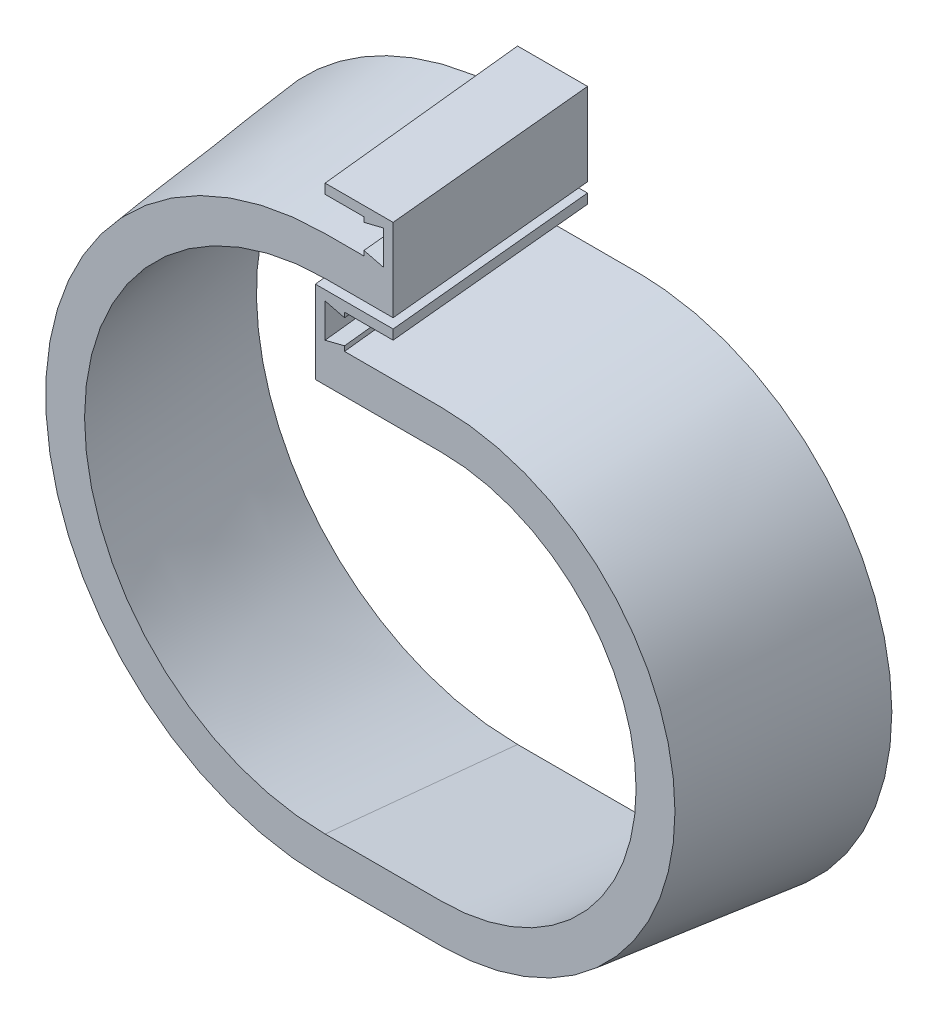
ISO-10303-21;
HEADER;
FILE_DESCRIPTION(('STEP AP214'),'2;1');
FILE_NAME('part.step','',(''),(''),'','','');
FILE_SCHEMA(('AUTOMOTIVE_DESIGN { 1 0 10303 214 1 1 1 1 }'));
ENDSEC;
DATA;
#1=APPLICATION_CONTEXT('core data for automotive mechanical design processes');
#2=APPLICATION_PROTOCOL_DEFINITION('international standard','automotive_design',2000,#1);
#3=PRODUCT_CONTEXT('',#1,'mechanical');
#4=PRODUCT('Part','Part','',(#3));
#5=PRODUCT_RELATED_PRODUCT_CATEGORY('part','',(#4));
#6=PRODUCT_DEFINITION_FORMATION('','',#4);
#7=PRODUCT_DEFINITION_CONTEXT('part definition',#1,'design');
#8=PRODUCT_DEFINITION('design','',#6,#7);
#9=PRODUCT_DEFINITION_SHAPE('','',#8);
#10=(LENGTH_UNIT() NAMED_UNIT(*) SI_UNIT(.MILLI.,.METRE.));
#11=(NAMED_UNIT(*) PLANE_ANGLE_UNIT() SI_UNIT($,.RADIAN.));
#12=(NAMED_UNIT(*) SI_UNIT($,.STERADIAN.) SOLID_ANGLE_UNIT());
#13=UNCERTAINTY_MEASURE_WITH_UNIT(LENGTH_MEASURE(1.E-05),#10,'distance_accuracy_value','');
#14=(GEOMETRIC_REPRESENTATION_CONTEXT(3) GLOBAL_UNCERTAINTY_ASSIGNED_CONTEXT((#13)) GLOBAL_UNIT_ASSIGNED_CONTEXT((#10,
#11,#12)) REPRESENTATION_CONTEXT('',''));
#15=CARTESIAN_POINT('',(0.,0.,0.));
#16=DIRECTION('',(0.,0.,1.));
#17=DIRECTION('',(1.,0.,0.));
#18=AXIS2_PLACEMENT_3D('',#15,#16,#17);
#19=CARTESIAN_POINT('',(0.,55.,-203.2));
#20=CARTESIAN_POINT('',(0.,33.5,0.));
#21=CARTESIAN_POINT('',(-0.666666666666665,55.,-203.2));
#22=CARTESIAN_POINT('',(-0.499999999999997,33.5,0.));
#23=CARTESIAN_POINT('',(-1.95853323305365,55.0000000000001,-203.2));
#24=CARTESIAN_POINT('',(-1.53224593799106,33.5,0.));
#25=CARTESIAN_POINT('',(-3.866435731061,54.9999999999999,-203.2));
#26=CARTESIAN_POINT('',(-3.10654982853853,33.4999999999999,0.));
#27=CARTESIAN_POINT('',(-5.82683340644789,55.,-203.2));
#28=CARTESIAN_POINT('',(-4.62208469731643,33.5000000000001,0.));
#29=CARTESIAN_POINT('',(-7.23468593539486,55.,-203.2));
#30=CARTESIAN_POINT('',(-5.5555684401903,33.5,0.));
#31=CARTESIAN_POINT('',(-11.2641929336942,55.,-203.2));
#32=CARTESIAN_POINT('',(-7.89557519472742,33.5,0.));
#33=CARTESIAN_POINT('',(-17.8045684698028,54.3619388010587,-203.2));
#34=CARTESIAN_POINT('',(-11.6794164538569,33.1237276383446,0.));
#35=CARTESIAN_POINT('',(-27.2723440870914,51.5071710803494,-203.200000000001));
#36=CARTESIAN_POINT('',(-17.1191804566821,31.4648699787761,0.));
#37=CARTESIAN_POINT('',(-36.0255986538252,46.8496743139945,-203.199999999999));
#38=CARTESIAN_POINT('',(-22.1146839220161,28.7805071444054,0.));
#39=CARTESIAN_POINT('',(-43.7171382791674,40.5582054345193,-203.200000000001));
#40=CARTESIAN_POINT('',(-26.4870256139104,25.1854971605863,0.));
#41=CARTESIAN_POINT('',(-50.0390461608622,32.8703201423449,-203.199999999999));
#42=CARTESIAN_POINT('',(-30.0636754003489,20.8105540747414,0.));
#43=CARTESIAN_POINT('',(-54.7369896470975,24.0824946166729,-203.200000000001));
#44=CARTESIAN_POINT('',(-32.7288159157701,15.8344322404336,0.));
#45=CARTESIAN_POINT('',(-57.6216558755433,14.5380344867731,-203.199999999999));
#46=CARTESIAN_POINT('',(-34.3666297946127,10.4358860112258,0.));
#47=CARTESIAN_POINT('',(-58.5775014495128,4.61225139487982,-203.200000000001));
#48=CARTESIAN_POINT('',(-34.9357954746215,4.82353372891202,0.));
#49=CARTESIAN_POINT('',(-57.5679117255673,-5.30374786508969,-203.199999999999));
#50=CARTESIAN_POINT('',(-34.3949913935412,-0.794006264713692,0.));
#51=CARTESIAN_POINT('',(-54.6367351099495,-14.8201211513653,-203.200000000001));
#52=CARTESIAN_POINT('',(-32.7819896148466,-6.20691884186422,0.));
#53=CARTESIAN_POINT('',(-49.9059421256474,-23.5652168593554,-203.2));
#54=CARTESIAN_POINT('',(-30.1345622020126,-11.2053888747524,0.));
#55=CARTESIAN_POINT('',(-43.5697389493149,-31.201421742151,-203.2));
#56=CARTESIAN_POINT('',(-26.5663084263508,-15.6074275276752,0.));
#57=CARTESIAN_POINT('',(-35.8852384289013,-37.4393924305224,-203.2));
#58=CARTESIAN_POINT('',(-22.190827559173,-19.2310459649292,0.));
#59=CARTESIAN_POINT('',(-27.1606532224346,-42.0494426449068,-203.199999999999));
#60=CARTESIAN_POINT('',(-17.1805874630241,-21.9411891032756,0.));
#61=CARTESIAN_POINT('',(-17.7408520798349,-44.870566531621,-203.2));
#62=CARTESIAN_POINT('',(-11.7149504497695,-23.6187749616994,0.));
#63=CARTESIAN_POINT('',(-11.2421188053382,-45.5,-203.2));
#64=CARTESIAN_POINT('',(-7.90800963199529,-24.,0.));
#65=CARTESIAN_POINT('',(-6.47972275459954,-45.5,-203.2));
#66=CARTESIAN_POINT('',(-5.10530618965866,-24.,0.));
#67=CARTESIAN_POINT('',(-3.79304055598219,-45.5000000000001,-203.2));
#68=CARTESIAN_POINT('',(-3.1708275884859,-24.,0.));
#69=CARTESIAN_POINT('',(-0.0588727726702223,-45.4999999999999,-203.2));
#70=CARTESIAN_POINT('',(0.0699625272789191,-24.,0.));
#71=CARTESIAN_POINT('',(3.69717185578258,-45.5000000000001,-203.2));
#72=CARTESIAN_POINT('',(3.26264972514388,-24.,0.));
#73=CARTESIAN_POINT('',(6.42696035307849,-45.5,-203.2));
#74=CARTESIAN_POINT('',(5.13502744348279,-24.,0.));
#75=CARTESIAN_POINT('',(10.9180414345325,-45.5,-203.2));
#76=CARTESIAN_POINT('',(7.60455317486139,-24.,0.));
#77=CARTESIAN_POINT('',(16.7760021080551,-44.9368462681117,-203.2));
#78=CARTESIAN_POINT('',(10.799526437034,-23.6764086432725,0.));
#79=CARTESIAN_POINT('',(25.292293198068,-42.3985100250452,-203.2));
#80=CARTESIAN_POINT('',(15.3716704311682,-22.266857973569,0.));
#81=CARTESIAN_POINT('',(33.2008254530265,-38.2342680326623,-203.2));
#82=CARTESIAN_POINT('',(19.5480206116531,-19.995392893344,0.));
#83=CARTESIAN_POINT('',(40.1807464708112,-32.5818434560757,-203.2));
#84=CARTESIAN_POINT('',(23.1883903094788,-16.9726862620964,0.));
#85=CARTESIAN_POINT('',(45.9427143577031,-25.6459332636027,-203.2));
#86=CARTESIAN_POINT('',(26.1525928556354,-13.3094109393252,0.));
#87=CARTESIAN_POINT('',(50.2439692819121,-17.6902756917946,-203.2));
#88=CARTESIAN_POINT('',(28.351308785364,-9.15600977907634,0.));
#89=CARTESIAN_POINT('',(52.9010287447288,-9.02651705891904,-203.199999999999));
#90=CARTESIAN_POINT('',(29.6952186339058,-4.66292563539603,0.));
#91=CARTESIAN_POINT('',(53.7996497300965,0.,-203.200000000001));
#92=CARTESIAN_POINT('',(30.1534720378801,0.,0.));
#93=CARTESIAN_POINT('',(52.9010287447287,9.02651705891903,-203.2));
#94=CARTESIAN_POINT('',(29.6952186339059,4.66292563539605,0.));
#95=CARTESIAN_POINT('',(50.2439692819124,17.6902756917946,-203.2));
#96=CARTESIAN_POINT('',(28.351308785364,9.15600977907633,0.));
#97=CARTESIAN_POINT('',(45.9427143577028,25.6459332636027,-203.2));
#98=CARTESIAN_POINT('',(26.1525928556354,13.3094109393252,0.));
#99=CARTESIAN_POINT('',(40.1807464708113,32.5818434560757,-203.2));
#100=CARTESIAN_POINT('',(23.1883903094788,16.9726862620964,0.));
#101=CARTESIAN_POINT('',(33.2008254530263,38.2342680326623,-203.2));
#102=CARTESIAN_POINT('',(19.5480206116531,19.995392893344,0.));
#103=CARTESIAN_POINT('',(25.292293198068,42.3985100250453,-203.2));
#104=CARTESIAN_POINT('',(15.3716704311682,22.266857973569,0.));
#105=CARTESIAN_POINT('',(16.776002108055,44.9368462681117,-203.2));
#106=CARTESIAN_POINT('',(10.799526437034,23.6764086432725,0.));
#107=CARTESIAN_POINT('',(10.9180414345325,45.5,-203.2));
#108=CARTESIAN_POINT('',(7.60455317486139,24.,0.));
#109=CARTESIAN_POINT('',(6.42696035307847,45.5,-203.2));
#110=CARTESIAN_POINT('',(5.13502744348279,24.,0.));
#111=CARTESIAN_POINT('',(3.59097487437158,45.5,-203.2));
#112=CARTESIAN_POINT('',(3.302436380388,24.,0.));
#113=CARTESIAN_POINT('',(-0.31357423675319,45.5,-203.2));
#114=CARTESIAN_POINT('',(0.269273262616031,24.,0.));
#115=CARTESIAN_POINT('',(-4.09728874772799,45.5,-203.2));
#116=CARTESIAN_POINT('',(-2.91882132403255,24.,0.));
#117=CARTESIAN_POINT('',(-6.66666666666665,45.5,-203.2));
#118=CARTESIAN_POINT('',(-5.,24.,0.));
#119=CARTESIAN_POINT('',(-8.,45.5,-203.2));
#120=CARTESIAN_POINT('',(-6.,24.,0.));
#121=B_SPLINE_SURFACE_WITH_KNOTS('',3,1,((#19,#20),(#21,#22),(#23,#24),(#25,#26),(#27,#28),(#29,
#30),(#31,#32),(#33,#34),(#35,#36),(#37,#38),(#39,#40),(#41,#42),(#43,#44),(#45,#46),(#47,#48),
(#49,#50),(#51,#52),(#53,#54),(#55,#56),(#57,#58),(#59,#60),(#61,#62),(#63,#64),(#65,#66),(#67,
#68),(#69,#70),(#71,#72),(#73,#74),(#75,#76),(#77,#78),(#79,#80),(#81,#82),(#83,#84),(#85,#86),
(#87,#88),(#89,#90),(#91,#92),(#93,#94),(#95,#96),(#97,#98),(#99,#100),(#101,#102),(#103,#104),
(#105,#106),(#107,#108),(#109,#110),(#111,#112),(#113,#114),(#115,#116),(#117,#118),(#119,
#120)),.UNSPECIFIED.,.F.,.F.,.F.,(4,1,1,1,2,1,1,1,1,1,1,1,1,1,1,1,1,1,1,1,2,1,1,1,2,1,1,1,1,1,1,
1,1,1,1,1,1,1,1,1,2,1,1,1,4),(2,2),(0.,0.00677489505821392,0.0135497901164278,
0.0203246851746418,0.0270995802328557,0.0559956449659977,0.0848917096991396,0.113787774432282,
0.142683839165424,0.171579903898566,0.200475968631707,0.22937203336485,0.258268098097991,
0.287164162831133,0.316060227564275,0.344956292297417,0.373852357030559,0.402748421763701,
0.431644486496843,0.460540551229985,0.489436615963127,0.502986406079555,0.516536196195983,
0.530085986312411,0.543635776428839,0.568771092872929,0.59390640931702,0.619041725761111,
0.644177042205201,0.669312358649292,0.694447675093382,0.719582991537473,0.744718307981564,
0.769853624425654,0.794988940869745,0.820124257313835,0.845259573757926,0.870394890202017,
0.895530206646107,0.920665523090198,0.945800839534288,0.959350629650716,0.972900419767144,
0.986450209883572,1.),(0.,1.),.UNSPECIFIED.);
#122=DIRECTION('',(0.,-0.10521975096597,0.994448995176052));
#123=VECTOR('',#122,1.);
#124=CARTESIAN_POINT('',(-2.,55.,-203.2));
#125=LINE('',#124,#123);
#126=CARTESIAN_POINT('',(-2.,35.6161417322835,-20.));
#127=VERTEX_POINT('',#126);
#128=CARTESIAN_POINT('',(-2.,33.5,0.));
#129=VERTEX_POINT('',#128);
#130=EDGE_CURVE('E696',#127,#129,#125,.T.);
#131=CARTESIAN_POINT('',(-0.326274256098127,35.6161417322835,-20.));
#132=CARTESIAN_POINT('',(-0.766421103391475,35.6161417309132,-20.));
#133=CARTESIAN_POINT('',(-1.20656795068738,35.6161417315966,-20.));
#134=CARTESIAN_POINT('',(-2.08914684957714,35.616141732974,-20.));
#135=CARTESIAN_POINT('',(-2.53157890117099,35.616141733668,-20.));
#136=CARTESIAN_POINT('',(-3.19598944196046,35.6161417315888,-20.));
#137=CARTESIAN_POINT('',(-3.41796793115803,35.6161417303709,-20.));
#138=CARTESIAN_POINT('',(-3.86192270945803,35.616141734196,-20.));
#139=CARTESIAN_POINT('',(-4.08389899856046,35.616141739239,-20.));
#140=CARTESIAN_POINT('',(-4.4170520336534,35.6161417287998,-20.));
#141=CARTESIAN_POINT('',(-4.52822877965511,35.6161417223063,-20.));
#142=CARTESIAN_POINT('',(-4.75058224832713,35.6161417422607,-20.));
#143=CARTESIAN_POINT('',(-4.86175897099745,35.6161417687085,-20.));
#144=CARTESIAN_POINT('',(-5.08411642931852,35.6161416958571,-20.));
#145=CARTESIAN_POINT('',(-5.19529716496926,35.6161415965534,-20.));
#146=CARTESIAN_POINT('',(-5.41765872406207,35.6161418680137,-20.));
#147=CARTESIAN_POINT('',(-5.52883954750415,35.6161422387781,-20.));
#148=CARTESIAN_POINT('',(-5.69561424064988,35.6161414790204,-20.));
#149=CARTESIAN_POINT('',(-5.75120811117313,35.6161410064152,-20.));
#150=CARTESIAN_POINT('',(-5.86239591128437,35.6161424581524,-20.));
#151=CARTESIAN_POINT('',(-5.91798984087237,35.6161443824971,-20.));
#152=CARTESIAN_POINT('',(-6.02917763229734,35.6161390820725,-20.));
#153=CARTESIAN_POINT('',(-6.08477149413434,35.6161318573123,-20.));
#154=CARTESIAN_POINT('',(-6.16816226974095,35.6161466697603,-20.));
#155=CARTESIAN_POINT('',(-6.19595916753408,35.6161558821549,-20.));
#156=CARTESIAN_POINT('',(-6.25155287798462,35.6161040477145,-20.));
#157=CARTESIAN_POINT('',(-6.2793496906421,35.6160430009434,-20.));
#158=CARTESIAN_POINT('',(-6.41832548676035,35.6155480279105,-20.));
#159=CARTESIAN_POINT('',(-6.52950308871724,35.6145448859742,-20.));
#160=CARTESIAN_POINT('',(-6.75184023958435,35.6113371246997,-20.));
#161=CARTESIAN_POINT('',(-6.86299978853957,35.6091325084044,-20.));
#162=CARTESIAN_POINT('',(-7.0859567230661,35.6035031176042,-20.));
#163=CARTESIAN_POINT('',(-7.19775392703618,35.6000710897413,-20.));
#164=CARTESIAN_POINT('',(-7.42130456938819,35.591991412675,-20.));
#165=CARTESIAN_POINT('',(-7.5330580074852,35.587343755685,-20.));
#166=CARTESIAN_POINT('',(-7.86825073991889,35.5715781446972,-20.));
#167=CARTESIAN_POINT('',(-8.09160718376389,35.5586379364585,-20.));
#168=CARTESIAN_POINT('',(-8.53748064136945,35.5279445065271,-20.));
#169=CARTESIAN_POINT('',(-8.75999841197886,35.5102022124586,-20.));
#170=CARTESIAN_POINT('',(-9.20458972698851,35.4699034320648,-20.));
#171=CARTESIAN_POINT('',(-9.42666328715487,35.4473471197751,-20.));
#172=CARTESIAN_POINT('',(-9.86993798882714,35.3974682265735,-20.));
#173=CARTESIAN_POINT('',(-10.0911399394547,35.3701528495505,-20.));
#174=CARTESIAN_POINT('',(-10.5329002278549,35.3107446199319,-20.));
#175=CARTESIAN_POINT('',(-10.7534585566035,35.2786517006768,-20.));
#176=CARTESIAN_POINT('',(-11.4136535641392,35.175278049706,-20.));
#177=CARTESIAN_POINT('',(-11.8521968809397,35.0968589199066,-20.));
#178=CARTESIAN_POINT('',(-12.7254020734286,34.9210934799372,-20.));
#179=CARTESIAN_POINT('',(-13.1600643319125,34.8237490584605,-20.));
#180=CARTESIAN_POINT('',(-14.1547342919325,34.5782817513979,-20.));
#181=CARTESIAN_POINT('',(-14.7131595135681,34.4236900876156,-20.));
#182=CARTESIAN_POINT('',(-15.8210768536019,34.0831824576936,-20.));
#183=CARTESIAN_POINT('',(-16.3705577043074,33.8972298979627,-20.));
#184=CARTESIAN_POINT('',(-17.4583134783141,33.4945414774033,-20.));
#185=CARTESIAN_POINT('',(-17.9965850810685,33.2777966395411,-20.));
#186=CARTESIAN_POINT('',(-19.0583657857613,32.8149067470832,-20.));
#187=CARTESIAN_POINT('',(-19.5819150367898,32.568853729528,-20.));
#188=CARTESIAN_POINT('',(-20.6141658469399,32.0478882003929,-20.));
#189=CARTESIAN_POINT('',(-21.1228740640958,31.7729888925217,-20.));
#190=CARTESIAN_POINT('',(-22.1240176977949,31.1952164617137,-20.));
#191=CARTESIAN_POINT('',(-22.6164547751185,30.8923462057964,-20.));
#192=CARTESIAN_POINT('',(-23.8261220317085,30.1007480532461,-20.));
#193=CARTESIAN_POINT('',(-24.5323275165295,29.5949454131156,-20.));
#194=CARTESIAN_POINT('',(-25.5576638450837,28.7932353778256,-20.));
#195=CARTESIAN_POINT('',(-25.8938341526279,28.5187813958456,-20.));
#196=CARTESIAN_POINT('',(-26.5543238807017,27.9559221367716,-20.));
#197=CARTESIAN_POINT('',(-26.8786435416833,27.6675171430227,-20.));
#198=CARTESIAN_POINT('',(-27.5151729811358,27.076854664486,-20.));
#199=CARTESIAN_POINT('',(-27.8273667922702,26.7745799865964,-20.));
#200=CARTESIAN_POINT('',(-28.438589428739,26.156997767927,-20.));
#201=CARTESIAN_POINT('',(-28.7376181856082,25.8416901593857,-20.));
#202=CARTESIAN_POINT('',(-29.3220734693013,25.1986803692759,-20.));
#203=CARTESIAN_POINT('',(-29.6074994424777,24.8709776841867,-20.));
#204=CARTESIAN_POINT('',(-30.1642675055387,24.2038559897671,-20.));
#205=CARTESIAN_POINT('',(-30.4356095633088,23.8644369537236,-20.));
#206=CARTESIAN_POINT('',(-31.2266481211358,22.8311019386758,-20.));
#207=CARTESIAN_POINT('',(-31.7248169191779,22.1205002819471,-20.));
#208=CARTESIAN_POINT('',(-32.6597308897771,20.6603713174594,-20.));
#209=CARTESIAN_POINT('',(-33.0964917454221,19.9108540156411,-20.));
#210=CARTESIAN_POINT('',(-33.905223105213,18.3783862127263,-20.));
#211=CARTESIAN_POINT('',(-34.2772473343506,17.5954641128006,-20.));
#212=CARTESIAN_POINT('',(-34.9537761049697,16.0000507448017,-20.));
#213=CARTESIAN_POINT('',(-35.2582133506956,15.1875309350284,-20.));
#214=CARTESIAN_POINT('',(-35.797791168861,13.5391856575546,-20.));
#215=CARTESIAN_POINT('',(-36.0328801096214,12.703343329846,-20.));
#216=CARTESIAN_POINT('',(-36.4322026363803,11.0147850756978,-20.));
#217=CARTESIAN_POINT('',(-36.5964362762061,10.1620691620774,-20.));
#218=CARTESIAN_POINT('',(-36.788736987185,8.87501855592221,-20.));
#219=CARTESIAN_POINT('',(-36.843836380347,8.44455686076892,-20.));
#220=CARTESIAN_POINT('',(-36.9358723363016,7.58176671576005,-20.));
#221=CARTESIAN_POINT('',(-36.9728130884,7.14943871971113,-20.));
#222=CARTESIAN_POINT('',(-37.0284010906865,6.28376693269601,-20.));
#223=CARTESIAN_POINT('',(-37.0470547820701,5.85042355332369,-20.));
#224=CARTESIAN_POINT('',(-37.0659298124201,4.98334784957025,-20.));
#225=CARTESIAN_POINT('',(-37.0661517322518,4.54961553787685,-20.));
#226=CARTESIAN_POINT('',(-37.0481551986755,3.68178006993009,-20.));
#227=CARTESIAN_POINT('',(-37.0299049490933,3.24767756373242,-20.));
#228=CARTESIAN_POINT('',(-36.9750858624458,2.38072662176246,-20.));
#229=CARTESIAN_POINT('',(-36.9385198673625,1.94787800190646,-20.));
#230=CARTESIAN_POINT('',(-36.8016109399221,0.65297367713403,-20.));
#231=CARTESIAN_POINT('',(-36.6740376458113,-0.206352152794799,-20.));
#232=CARTESIAN_POINT('',(-36.3472475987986,-1.91153402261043,-20.));
#233=CARTESIAN_POINT('',(-36.1480097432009,-2.75738601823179,-20.));
#234=CARTESIAN_POINT('',(-35.7964363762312,-4.01125098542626,-20.));
#235=CARTESIAN_POINT('',(-35.6704292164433,-4.42680064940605,-20.));
#236=CARTESIAN_POINT('',(-35.4009796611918,-5.25223657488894,-20.));
#237=CARTESIAN_POINT('',(-35.2575373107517,-5.66212285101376,-20.));
#238=CARTESIAN_POINT('',(-34.9532563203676,-6.47575265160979,-20.));
#239=CARTESIAN_POINT('',(-34.7924039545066,-6.87949103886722,-20.));
#240=CARTESIAN_POINT('',(-34.4536252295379,-7.67973949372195,-20.));
#241=CARTESIAN_POINT('',(-34.2756988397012,-8.07624954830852,-20.));
#242=CARTESIAN_POINT('',(-33.9032174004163,-8.86138666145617,-20.));
#243=CARTESIAN_POINT('',(-33.7086623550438,-9.25001372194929,-20.));
#244=CARTESIAN_POINT('',(-33.3033593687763,-10.0186968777,-20.));
#245=CARTESIAN_POINT('',(-33.0926113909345,-10.3987529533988,-20.));
#246=CARTESIAN_POINT('',(-32.4366826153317,-11.5251010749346,-20.));
#247=CARTESIAN_POINT('',(-31.9677358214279,-12.2577439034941,-20.));
#248=CARTESIAN_POINT('',(-30.9701145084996,-13.6809727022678,-20.));
#249=CARTESIAN_POINT('',(-30.4414425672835,-14.3715604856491,-20.));
#250=CARTESIAN_POINT('',(-29.3283758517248,-15.7051033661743,-20.));
#251=CARTESIAN_POINT('',(-28.7440402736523,-16.3481078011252,-20.));
#252=CARTESIAN_POINT('',(-27.5227343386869,-17.5821279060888,-20.));
#253=CARTESIAN_POINT('',(-26.8857594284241,-18.1731390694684,-20.));
#254=CARTESIAN_POINT('',(-25.5639277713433,-19.2997018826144,-20.));
#255=CARTESIAN_POINT('',(-24.8790433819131,-19.8352210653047,-20.));
#256=CARTESIAN_POINT('',(-23.4667559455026,-20.8466391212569,-20.));
#257=CARTESIAN_POINT('',(-22.7393639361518,-21.3225533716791,-20.));
#258=CARTESIAN_POINT('',(-21.4963219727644,-22.0631294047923,-20.));
#259=CARTESIAN_POINT('',(-20.9910032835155,-22.3452941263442,-20.));
#260=CARTESIAN_POINT('',(-19.9652059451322,-22.880926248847,-20.));
#261=CARTESIAN_POINT('',(-19.4447242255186,-23.1343877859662,-20.));
#262=CARTESIAN_POINT('',(-18.3898758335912,-23.6117487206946,-20.));
#263=CARTESIAN_POINT('',(-17.8554982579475,-23.8356240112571,-20.));
#264=CARTESIAN_POINT('',(-16.7766409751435,-24.2521961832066,-20.));
#265=CARTESIAN_POINT('',(-16.2321980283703,-24.4449882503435,-20.));
#266=CARTESIAN_POINT('',(-15.1336562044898,-24.7996810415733,-20.));
#267=CARTESIAN_POINT('',(-14.5795623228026,-24.9615972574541,-20.));
#268=CARTESIAN_POINT('',(-13.4642262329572,-25.2538717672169,-20.));
#269=CARTESIAN_POINT('',(-12.9030000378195,-25.38429087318,-20.));
#270=CARTESIAN_POINT('',(-12.073624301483,-25.5526671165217,-20.));
#271=CARTESIAN_POINT('',(-11.8079273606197,-25.6029739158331,-20.));
#272=CARTESIAN_POINT('',(-11.2753022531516,-25.6965853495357,-20.));
#273=CARTESIAN_POINT('',(-11.0083741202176,-25.7398901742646,-20.));
#274=CARTESIAN_POINT('',(-10.4734060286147,-25.8194874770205,-20.));
#275=CARTESIAN_POINT('',(-10.2053658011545,-25.855778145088,-20.));
#276=CARTESIAN_POINT('',(-9.66840900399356,-25.9213154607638,-20.));
#277=CARTESIAN_POINT('',(-9.39949238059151,-25.9505616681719,-20.));
#278=CARTESIAN_POINT('',(-8.86061246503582,-26.0020225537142,-20.));
#279=CARTESIAN_POINT('',(-8.59064824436,-26.0242275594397,-20.));
#280=CARTESIAN_POINT('',(-8.1853605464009,-26.0522037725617,-20.));
#281=CARTESIAN_POINT('',(-8.05021598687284,-26.0606402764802,-20.));
#282=CARTESIAN_POINT('',(-7.77982476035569,-26.0757351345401,-20.));
#283=CARTESIAN_POINT('',(-7.6445780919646,-26.0823934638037,-20.));
#284=CARTESIAN_POINT('',(-7.37369254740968,-26.0939423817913,-20.));
#285=CARTESIAN_POINT('',(-7.23805349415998,-26.0988287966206,-20.));
#286=CARTESIAN_POINT('',(-6.96672660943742,-26.1068111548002,-20.));
#287=CARTESIAN_POINT('',(-6.83103877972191,-26.1099071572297,-20.));
#288=CARTESIAN_POINT('',(-6.62747735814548,-26.11320234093,-20.));
#289=CARTESIAN_POINT('',(-6.55961398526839,-26.1140759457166,-20.));
#290=CARTESIAN_POINT('',(-6.4238827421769,-26.1153807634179,-20.));
#291=CARTESIAN_POINT('',(-6.35601487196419,-26.1158119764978,-20.));
#292=CARTESIAN_POINT('',(-6.22027633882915,-26.1162005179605,-20.));
#293=CARTESIAN_POINT('',(-6.15240567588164,-26.1161578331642,-20.));
#294=CARTESIAN_POINT('',(-6.01666441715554,-26.116125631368,-20.));
#295=CARTESIAN_POINT('',(-5.94879382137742,-26.1161361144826,-20.));
#296=CARTESIAN_POINT('',(-5.74518869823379,-26.1161529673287,-20.));
#297=CARTESIAN_POINT('',(-5.60945411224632,-26.1161447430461,-20.));
#298=CARTESIAN_POINT('',(-5.33798510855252,-26.1161387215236,-20.));
#299=CARTESIAN_POINT('',(-5.20225069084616,-26.1161409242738,-20.));
#300=CARTESIAN_POINT('',(-4.93079038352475,-26.1161425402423,-20.));
#301=CARTESIAN_POINT('',(-4.79506449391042,-26.1161419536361,-20.));
#302=CARTESIAN_POINT('',(-4.52361268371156,-26.1161415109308,-20.));
#303=CARTESIAN_POINT('',(-4.38788676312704,-26.116141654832,-20.));
#304=CARTESIAN_POINT('',(-3.97816081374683,-26.1161418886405,-20.));
#305=CARTESIAN_POINT('',(-3.70416078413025,-26.1161417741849,-20.));
#306=CARTESIAN_POINT('',(-3.15615606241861,-26.1161416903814,-20.));
#307=CARTESIAN_POINT('',(-2.88215137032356,-26.116141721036,-20.));
#308=CARTESIAN_POINT('',(-2.33453511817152,-26.1161417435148,-20.));
#309=CARTESIAN_POINT('',(-2.06092355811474,-26.1161417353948,-20.));
#310=CARTESIAN_POINT('',(-1.51370169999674,-26.1161417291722,-20.));
#311=CARTESIAN_POINT('',(-1.24009140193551,-26.1161417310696,-20.));
#312=CARTESIAN_POINT('',(-0.41962898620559,-26.1161417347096,-20.));
#313=CARTESIAN_POINT('',(0.127223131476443,-26.1161417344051,-20.));
#314=CARTESIAN_POINT('',(1.22097074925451,-26.1161417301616,-20.));
#315=CARTESIAN_POINT('',(1.76786624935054,-26.1161417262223,-20.));
#316=CARTESIAN_POINT('',(2.58843731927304,-26.1161417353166,-20.));
#317=CARTESIAN_POINT('',(2.86211288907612,-26.1161417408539,-20.));
#318=CARTESIAN_POINT('',(3.40946489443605,-26.1161417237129,-20.));
#319=CARTESIAN_POINT('',(3.6831413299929,-26.1161417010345,-20.));
#320=CARTESIAN_POINT('',(4.12724005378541,-26.1161417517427,-20.));
#321=CARTESIAN_POINT('',(4.29766234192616,-26.1161417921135,-20.));
#322=CARTESIAN_POINT('',(4.63850522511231,-26.116141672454,-20.));
#323=CARTESIAN_POINT('',(4.80892582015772,-26.1161415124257,-20.));
#324=CARTESIAN_POINT('',(5.14981303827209,-26.1161419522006,-20.));
#325=CARTESIAN_POINT('',(5.32027966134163,-26.1161425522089,-20.));
#326=CARTESIAN_POINT('',(5.57598254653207,-26.1161413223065,-20.));
#327=CARTESIAN_POINT('',(5.66121881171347,-26.1161405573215,-20.));
#328=CARTESIAN_POINT('',(5.83169140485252,-26.1161429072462,-20.));
#329=CARTESIAN_POINT('',(5.91692773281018,-26.1161460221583,-20.));
#330=CARTESIAN_POINT('',(6.04475804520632,-26.1161395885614,-20.));
#331=CARTESIAN_POINT('',(6.08735204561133,-26.1161355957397,-20.));
#332=CARTESIAN_POINT('',(6.17254004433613,-26.1161478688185,-20.));
#333=CARTESIAN_POINT('',(6.21513404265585,-26.1161641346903,-20.));
#334=CARTESIAN_POINT('',(6.34291408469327,-26.1158829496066,-20.));
#335=CARTESIAN_POINT('',(6.42809973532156,-26.115255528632,-20.));
#336=CARTESIAN_POINT('',(6.59845453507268,-26.1131750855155,-20.));
#337=CARTESIAN_POINT('',(6.68362368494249,-26.1117221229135,-20.));
#338=CARTESIAN_POINT('',(6.85394491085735,-26.1079773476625,-20.));
#339=CARTESIAN_POINT('',(6.93909698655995,-26.1056855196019,-20.));
#340=CARTESIAN_POINT('',(7.1943600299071,-26.097563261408,-20.));
#341=CARTESIAN_POINT('',(7.3644329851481,-26.0904841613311,-20.));
#342=CARTESIAN_POINT('',(7.70441935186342,-26.0729987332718,-20.));
#343=CARTESIAN_POINT('',(7.87433275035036,-26.0625921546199,-20.));
#344=CARTESIAN_POINT('',(8.21392141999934,-26.0384608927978,-20.));
#345=CARTESIAN_POINT('',(8.38359669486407,-26.0247362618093,-20.));
#346=CARTESIAN_POINT('',(8.72264086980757,-25.993977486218,-20.));
#347=CARTESIAN_POINT('',(8.8920097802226,-25.9769434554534,-20.));
#348=CARTESIAN_POINT('',(9.22822541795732,-25.9398123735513,-20.));
#349=CARTESIAN_POINT('',(9.39507675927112,-25.919757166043,-20.));
#350=CARTESIAN_POINT('',(9.72836196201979,-25.8764375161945,-20.));
#351=CARTESIAN_POINT('',(9.89479581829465,-25.8531730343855,-20.));
#352=CARTESIAN_POINT('',(10.3938265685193,-25.7785115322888,-20.));
#353=CARTESIAN_POINT('',(10.7257161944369,-25.722294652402,-20.));
#354=CARTESIAN_POINT('',(11.3873593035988,-25.5970340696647,-20.));
#355=CARTESIAN_POINT('',(11.717110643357,-25.5279790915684,-20.));
#356=CARTESIAN_POINT('',(12.3738418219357,-25.3771508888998,-20.));
#357=CARTESIAN_POINT('',(12.7008204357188,-25.2953723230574,-20.));
#358=CARTESIAN_POINT('',(13.3513563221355,-25.1192508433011,-20.));
#359=CARTESIAN_POINT('',(13.674913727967,-25.0249084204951,-20.));
#360=CARTESIAN_POINT('',(14.404725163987,-24.796703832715,-20.));
#361=CARTESIAN_POINT('',(14.8097967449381,-24.6590394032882,-20.));
#362=CARTESIAN_POINT('',(15.6124111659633,-24.3640070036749,-20.));
#363=CARTESIAN_POINT('',(16.0099584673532,-24.2066511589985,-20.));
#364=CARTESIAN_POINT('',(16.7966610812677,-23.872500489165,-20.));
#365=CARTESIAN_POINT('',(17.1858188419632,-23.6957114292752,-20.));
#366=CARTESIAN_POINT('',(17.9549771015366,-23.3232215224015,-20.));
#367=CARTESIAN_POINT('',(18.3349774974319,-23.1275204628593,-20.));
#368=CARTESIAN_POINT('',(19.0884469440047,-22.7158418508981,-20.));
#369=CARTESIAN_POINT('',(19.4618218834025,-22.4996920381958,-20.));
#370=CARTESIAN_POINT('',(20.1975481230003,-22.0492017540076,-20.));
#371=CARTESIAN_POINT('',(20.5598968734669,-21.8148571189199,-20.));
#372=CARTESIAN_POINT('',(21.2726201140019,-21.3285803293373,-20.));
#373=CARTESIAN_POINT('',(21.6229940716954,-21.0766473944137,-20.));
#374=CARTESIAN_POINT('',(22.3108381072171,-20.5558467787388,-20.));
#375=CARTESIAN_POINT('',(22.6483099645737,-20.2869814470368,-20.));
#376=CARTESIAN_POINT('',(23.3551268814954,-19.6946986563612,-20.));
#377=CARTESIAN_POINT('',(23.7224555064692,-19.3688694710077,-20.));
#378=CARTESIAN_POINT('',(24.4379665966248,-18.6969884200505,-20.));
#379=CARTESIAN_POINT('',(24.7861533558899,-18.3509411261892,-20.));
#380=CARTESIAN_POINT('',(25.4622756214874,-17.6396407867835,-20.));
#381=CARTESIAN_POINT('',(25.7902124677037,-17.2743890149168,-20.));
#382=CARTESIAN_POINT('',(26.4237365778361,-16.5274684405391,-20.));
#383=CARTESIAN_POINT('',(26.7294066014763,-16.1458697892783,-20.));
#384=CARTESIAN_POINT('',(27.3189578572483,-15.366133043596,-20.));
#385=CARTESIAN_POINT('',(27.6028372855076,-14.9679935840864,-20.));
#386=CARTESIAN_POINT('',(28.147899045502,-14.1565015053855,-20.));
#387=CARTESIAN_POINT('',(28.409080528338,-13.7431483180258,-20.));
#388=CARTESIAN_POINT('',(29.0327437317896,-12.6921391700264,-20.));
#389=CARTESIAN_POINT('',(29.3805795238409,-12.045670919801,-20.));
#390=CARTESIAN_POINT('',(29.8604663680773,-11.0559704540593,-20.));
#391=CARTESIAN_POINT('',(30.0134617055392,-10.7227090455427,-20.));
#392=CARTESIAN_POINT('',(30.3051737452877,-10.0499945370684,-20.));
#393=CARTESIAN_POINT('',(30.4438907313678,-9.71054156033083,-20.));
#394=CARTESIAN_POINT('',(30.8385473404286,-8.68305843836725,-20.));
#395=CARTESIAN_POINT('',(31.0726939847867,-7.98652001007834,-20.));
#396=CARTESIAN_POINT('',(31.4816438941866,-6.57628438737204,-20.));
#397=CARTESIAN_POINT('',(31.6564429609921,-5.86258598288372,-20.));
#398=CARTESIAN_POINT('',(31.9455351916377,-4.4233362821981,-20.));
#399=CARTESIAN_POINT('',(32.0598525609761,-3.69778984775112,-20.));
#400=CARTESIAN_POINT('',(32.2271788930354,-2.23961043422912,-20.));
#401=CARTESIAN_POINT('',(32.2801919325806,-1.50697792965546,-20.));
#402=CARTESIAN_POINT('',(32.3130437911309,-0.406878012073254,-20.));
#403=CARTESIAN_POINT('',(32.3162160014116,-0.0399778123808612,-20.));
#404=CARTESIAN_POINT('',(32.3069602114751,0.693625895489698,-20.));
#405=CARTESIAN_POINT('',(32.2945321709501,1.0603294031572,-20.));
#406=CARTESIAN_POINT('',(32.234030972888,2.15916426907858,-20.));
#407=CARTESIAN_POINT('',(32.1627445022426,2.89014823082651,-20.));
#408=CARTESIAN_POINT('',(31.9591358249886,4.3435017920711,-20.));
#409=CARTESIAN_POINT('',(31.8268103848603,5.06587093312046,-20.));
#410=CARTESIAN_POINT('',(31.5020926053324,6.49698429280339,-20.));
#411=CARTESIAN_POINT('',(31.3097020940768,7.20572892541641,-20.));
#412=CARTESIAN_POINT('',(30.8660531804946,8.6042963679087,-20.));
#413=CARTESIAN_POINT('',(30.6148147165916,9.2941254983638,-20.));
#414=CARTESIAN_POINT('',(30.0546434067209,10.6499490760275,-20.));
#415=CARTESIAN_POINT('',(29.7457103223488,11.3159434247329,-20.));
#416=CARTESIAN_POINT('',(29.073013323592,12.6195319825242,-20.));
#417=CARTESIAN_POINT('',(28.7092555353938,13.2571293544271,-20.));
#418=CARTESIAN_POINT('',(27.9296294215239,14.4996120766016,-20.));
#419=CARTESIAN_POINT('',(27.5137600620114,15.104496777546,-20.));
#420=CARTESIAN_POINT('',(26.6320517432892,16.2782076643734,-20.));
#421=CARTESIAN_POINT('',(26.1661403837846,16.8469796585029,-20.));
#422=CARTESIAN_POINT('',(25.4326141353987,17.6689572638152,-20.));
#423=CARTESIAN_POINT('',(25.1822982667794,17.9377820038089,-20.));
#424=CARTESIAN_POINT('',(24.6704492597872,18.4645223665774,-20.));
#425=CARTESIAN_POINT('',(24.4089168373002,18.7224386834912,-20.));
#426=CARTESIAN_POINT('',(23.7855228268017,19.3116507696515,-20.));
#427=CARTESIAN_POINT('',(23.4194561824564,19.6385113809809,-20.));
#428=CARTESIAN_POINT('',(22.6695170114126,20.2711259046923,-20.));
#429=CARTESIAN_POINT('',(22.2856438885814,20.5768791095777,-20.));
#430=CARTESIAN_POINT('',(21.5013632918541,21.1663785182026,-20.));
#431=CARTESIAN_POINT('',(21.1009560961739,21.4501250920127,-20.));
#432=CARTESIAN_POINT('',(20.2865419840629,21.993616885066,-20.));
#433=CARTESIAN_POINT('',(19.8725975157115,22.253455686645,-20.));
#434=CARTESIAN_POINT('',(19.0308494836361,22.7496061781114,-20.));
#435=CARTESIAN_POINT('',(18.6030460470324,22.9859180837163,-20.));
#436=CARTESIAN_POINT('',(17.7348218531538,23.4342218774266,-20.));
#437=CARTESIAN_POINT('',(17.2944001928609,23.6462120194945,-20.));
#438=CARTESIAN_POINT('',(16.5139773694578,23.995074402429,-20.));
#439=CARTESIAN_POINT('',(16.1764315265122,24.137467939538,-20.));
#440=CARTESIAN_POINT('',(15.4955981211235,24.4078288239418,-20.));
#441=CARTESIAN_POINT('',(15.1523104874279,24.5357959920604,-20.));
#442=CARTESIAN_POINT('',(14.4606709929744,24.777147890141,-20.));
#443=CARTESIAN_POINT('',(14.1123194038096,24.8905333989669,-20.));
#444=CARTESIAN_POINT('',(13.4112066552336,25.102550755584,-20.));
#445=CARTESIAN_POINT('',(13.0584461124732,25.2011846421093,-20.));
#446=CARTESIAN_POINT('',(12.3459743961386,25.3843640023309,-20.));
#447=CARTESIAN_POINT('',(11.9862293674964,25.4687777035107,-20.));
#448=CARTESIAN_POINT('',(11.2634816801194,25.6222802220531,-20.));
#449=CARTESIAN_POINT('',(10.9004791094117,25.6913694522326,-20.));
#450=CARTESIAN_POINT('',(10.3540785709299,25.7834195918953,-20.));
#451=CARTESIAN_POINT('',(10.1716378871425,25.8121712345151,-20.));
#452=CARTESIAN_POINT('',(9.80618901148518,25.8658073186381,-20.));
#453=CARTESIAN_POINT('',(9.62318082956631,25.8906918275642,-20.));
#454=CARTESIAN_POINT('',(9.25673758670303,25.9365746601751,-20.));
#455=CARTESIAN_POINT('',(9.07330267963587,25.9575742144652,-20.));
#456=CARTESIAN_POINT('',(8.70602111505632,25.9956870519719,-20.));
#457=CARTESIAN_POINT('',(8.52217443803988,26.0128001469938,-20.));
#458=CARTESIAN_POINT('',(8.13897911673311,26.0443789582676,-20.));
#459=CARTESIAN_POINT('',(7.93960264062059,26.0585098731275,-20.));
#460=CARTESIAN_POINT('',(7.6403487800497,26.0762693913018,-20.));
#461=CARTESIAN_POINT('',(7.54057036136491,26.0816162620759,-20.));
#462=CARTESIAN_POINT('',(7.34095716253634,26.0911635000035,-20.));
#463=CARTESIAN_POINT('',(7.24112238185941,26.095363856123,-20.));
#464=CARTESIAN_POINT('',(7.04139438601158,26.1026164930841,-20.));
#465=CARTESIAN_POINT('',(6.94150116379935,26.1056685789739,-20.));
#466=CARTESIAN_POINT('',(6.74168827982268,26.1106238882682,-20.));
#467=CARTESIAN_POINT('',(6.6417686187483,26.1125271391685,-20.));
#468=CARTESIAN_POINT('',(6.49187334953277,26.1145143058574,-20.));
#469=CARTESIAN_POINT('',(6.44190309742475,26.1150320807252,-20.));
#470=CARTESIAN_POINT('',(6.34196026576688,26.1157867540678,-20.));
#471=CARTESIAN_POINT('',(6.29198768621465,26.1160236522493,-20.));
#472=CARTESIAN_POINT('',(6.2170280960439,26.1161418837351,-20.));
#473=CARTESIAN_POINT('',(6.19204120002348,26.1161417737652,-20.));
#474=CARTESIAN_POINT('',(6.14206740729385,26.1161416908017,-20.));
#475=CARTESIAN_POINT('',(6.11708051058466,26.1161417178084,-20.));
#476=CARTESIAN_POINT('',(6.04211981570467,26.1161417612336,-20.));
#477=CARTESIAN_POINT('',(5.99214601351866,26.1161417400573,-20.));
#478=CARTESIAN_POINT('',(5.89214878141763,26.1161417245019,-20.));
#479=CARTESIAN_POINT('',(5.84212535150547,26.1161417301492,-20.));
#480=CARTESIAN_POINT('',(5.742078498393,26.1161417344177,-20.));
#481=CARTESIAN_POINT('',(5.6920550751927,26.1161417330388,-20.));
#482=CARTESIAN_POINT('',(5.54198581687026,26.1161417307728,-20.));
#483=CARTESIAN_POINT('',(5.44193998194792,26.1161417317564,-20.));
#484=CARTESIAN_POINT('',(5.14181107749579,26.1161417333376,-20.));
#485=CARTESIAN_POINT('',(4.94172800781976,26.116141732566,-20.));
#486=CARTESIAN_POINT('',(4.54140683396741,26.1161417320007,-20.));
#487=CARTESIAN_POINT('',(4.34116872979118,26.1161417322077,-20.));
#488=CARTESIAN_POINT('',(3.94068994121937,26.1161417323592,-20.));
#489=CARTESIAN_POINT('',(3.74044925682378,26.1161417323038,-20.));
#490=CARTESIAN_POINT('',(3.33986957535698,26.1161417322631,-20.));
#491=CARTESIAN_POINT('',(3.13953057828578,26.1161417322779,-20.));
#492=CARTESIAN_POINT('',(2.73885327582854,26.116141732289,-20.));
#493=CARTESIAN_POINT('',(2.5385149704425,26.1161417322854,-20.));
#494=CARTESIAN_POINT('',(1.93740536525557,26.1161417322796,-20.));
#495=CARTESIAN_POINT('',(1.53663406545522,26.1161417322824,-20.));
#496=CARTESIAN_POINT('',(0.745419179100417,26.1161417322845,-20.));
#497=CARTESIAN_POINT('',(0.354975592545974,26.1161417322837,-20.));
#498=CARTESIAN_POINT('',(-0.425785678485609,26.1161417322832,-20.));
#499=CARTESIAN_POINT('',(-0.81610336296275,26.1161417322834,-20.));
#500=CARTESIAN_POINT('',(-1.59648877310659,26.1161417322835,-20.));
#501=CARTESIAN_POINT('',(-1.98655649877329,26.1161417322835,-20.));
#502=CARTESIAN_POINT('',(-2.76631793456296,26.1161417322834,-20.));
#503=CARTESIAN_POINT('',(-3.15601164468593,26.1161417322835,-20.));
#504=CARTESIAN_POINT('',(-3.93490099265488,26.1161417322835,-20.));
#505=CARTESIAN_POINT('',(-4.32409663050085,26.1161417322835,-20.));
#506=CARTESIAN_POINT('',(-5.10186577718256,26.1161417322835,-20.));
#507=CARTESIAN_POINT('',(-5.49043928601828,26.1161417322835,-20.));
#508=CARTESIAN_POINT('',(-5.87901279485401,26.1161417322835,-20.));
#509=B_SPLINE_CURVE_WITH_KNOTS('',3,(#131,#132,#133,#134,#135,#136,#137,#138,#139,#140,#141,
#142,#143,#144,#145,#146,#147,#148,#149,#150,#151,#152,#153,#154,#155,#156,#157,#158,#159,#160,
#161,#162,#163,#164,#165,#166,#167,#168,#169,#170,#171,#172,#173,#174,#175,#176,#177,#178,#179,
#180,#181,#182,#183,#184,#185,#186,#187,#188,#189,#190,#191,#192,#193,#194,#195,#196,#197,#198,
#199,#200,#201,#202,#203,#204,#205,#206,#207,#208,#209,#210,#211,#212,#213,#214,#215,#216,#217,
#218,#219,#220,#221,#222,#223,#224,#225,#226,#227,#228,#229,#230,#231,#232,#233,#234,#235,#236,
#237,#238,#239,#240,#241,#242,#243,#244,#245,#246,#247,#248,#249,#250,#251,#252,#253,#254,#255,
#256,#257,#258,#259,#260,#261,#262,#263,#264,#265,#266,#267,#268,#269,#270,#271,#272,#273,#274,
#275,#276,#277,#278,#279,#280,#281,#282,#283,#284,#285,#286,#287,#288,#289,#290,#291,#292,#293,
#294,#295,#296,#297,#298,#299,#300,#301,#302,#303,#304,#305,#306,#307,#308,#309,#310,#311,#312,
#313,#314,#315,#316,#317,#318,#319,#320,#321,#322,#323,#324,#325,#326,#327,#328,#329,#330,#331,
#332,#333,#334,#335,#336,#337,#338,#339,#340,#341,#342,#343,#344,#345,#346,#347,#348,#349,#350,
#351,#352,#353,#354,#355,#356,#357,#358,#359,#360,#361,#362,#363,#364,#365,#366,#367,#368,#369,
#370,#371,#372,#373,#374,#375,#376,#377,#378,#379,#380,#381,#382,#383,#384,#385,#386,#387,#388,
#389,#390,#391,#392,#393,#394,#395,#396,#397,#398,#399,#400,#401,#402,#403,#404,#405,#406,#407,
#408,#409,#410,#411,#412,#413,#414,#415,#416,#417,#418,#419,#420,#421,#422,#423,#424,#425,#426,
#427,#428,#429,#430,#431,#432,#433,#434,#435,#436,#437,#438,#439,#440,#441,#442,#443,#444,#445,
#446,#447,#448,#449,#450,#451,#452,#453,#454,#455,#456,#457,#458,#459,#460,#461,#462,#463,#464,
#465,#466,#467,#468,#469,#470,#471,#472,#473,#474,#475,#476,#477,#478,#479,#480,#481,#482,#483,
#484,#485,#486,#487,#488,#489,#490,#491,#492,#493,#494,#495,#496,#497,#498,#499,#500,#501,#502,
#503,#504,#505,#506,#507,#508),.UNSPECIFIED.,.F.,.F.,(4,2,2,2,2,2,2,2,2,2,2,2,2,2,2,2,2,2,2,2,2,
2,2,2,2,2,2,2,2,2,2,2,2,2,2,2,2,2,2,2,2,2,2,2,2,2,2,2,2,2,2,2,2,2,2,2,2,2,2,2,2,2,2,2,2,2,2,2,2,
2,2,2,2,2,2,2,2,2,2,2,2,2,2,2,2,2,2,2,2,2,2,2,2,2,2,2,2,2,2,2,2,2,2,2,2,2,2,2,2,2,2,2,2,2,2,2,2,
2,2,2,2,2,2,2,2,2,2,2,2,2,2,2,2,2,2,2,2,2,2,2,2,2,2,2,2,2,2,2,2,2,2,2,2,2,2,2,2,2,2,2,2,2,2,2,2,
2,2,2,2,2,2,2,2,2,2,2,2,2,2,2,2,2,2,2,2,2,2,2,4),(0.,1.32044054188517,2.64773669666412,
3.31367216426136,3.97960103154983,4.3131312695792,4.64666143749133,4.98020364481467,
5.31374611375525,5.48052772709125,5.64730950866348,5.81409112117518,5.89748178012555,
5.98087236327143,6.31441127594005,6.64794934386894,6.98349193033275,7.31903666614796,
7.99017194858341,8.65979265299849,9.32938915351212,9.9979807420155,10.6665816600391,
12.0026172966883,13.338519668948,15.0758476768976,16.8152170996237,18.5550946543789,
20.289645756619,22.0234063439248,23.7569894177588,26.3593804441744,27.6610125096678,
28.9626181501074,30.2658833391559,31.5691553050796,32.8724802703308,34.1758082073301,
36.775969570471,39.3754656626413,41.9727940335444,44.5726970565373,47.1745309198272,
49.7763628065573,51.0779702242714,52.3792772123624,53.6801256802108,54.9809331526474,
56.2839835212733,57.5868317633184,60.1898014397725,62.793538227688,64.0959184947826,
65.3982953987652,66.7017066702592,68.0051202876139,69.3085335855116,70.6119498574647,
73.2182166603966,75.8243710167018,78.4277841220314,81.0314226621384,83.6365760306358,
86.2410559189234,87.9765127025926,89.7123233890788,91.4495398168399,93.1813309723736,
94.9122509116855,96.639801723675,97.4509797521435,98.2621357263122,99.0735007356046,
99.8849164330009,100.697441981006,101.103655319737,101.509874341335,101.91704412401,
102.324200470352,102.527806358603,102.731412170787,102.935023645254,103.138635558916,
103.545839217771,103.953042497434,104.360220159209,104.767397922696,105.589398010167,
106.411412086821,107.232246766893,108.053077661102,109.693634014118,111.33432051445,
112.15534722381,112.976376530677,113.487643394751,113.998905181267,114.510305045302,
114.766013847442,115.021722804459,115.149504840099,115.277286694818,115.532845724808,
115.788386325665,116.043931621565,116.55455674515,117.065220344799,117.575875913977,
118.086513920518,118.590638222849,119.094768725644,120.10434616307,121.114814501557,
122.125708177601,123.13656235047,124.419501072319,125.701653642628,126.983426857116,
128.265214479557,129.558970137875,130.853022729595,132.147132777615,133.441063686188,
134.913305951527,136.385216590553,137.857029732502,139.323059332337,140.789210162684,
142.255415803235,144.454730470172,145.55456877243,146.654385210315,148.856064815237,
151.057900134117,153.258853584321,155.459660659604,156.56011431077,157.660570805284,
159.861100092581,162.061745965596,164.262324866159,166.462159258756,168.662002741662,
170.861600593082,173.06124208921,175.264110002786,176.36579576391,177.467411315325,
178.9388711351,180.410380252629,181.881864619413,183.347319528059,184.812760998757,
186.278307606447,187.377050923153,188.475807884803,189.574506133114,190.673052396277,
191.781276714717,192.889471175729,193.443514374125,193.99754791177,194.551405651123,
195.10529020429,195.704861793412,196.004621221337,196.304383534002,196.604196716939,
196.904002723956,197.053920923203,197.203839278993,197.278799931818,197.353760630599,
197.503682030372,197.653752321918,197.803822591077,198.103960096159,198.70420930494,
199.304923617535,199.905645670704,200.506662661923,201.10767757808,202.309991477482,
203.481322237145,204.652275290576,205.822478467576,206.991559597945,208.159146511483,
209.32486703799),.UNSPECIFIED.);
#510=CARTESIAN_POINT('',(-4.19685039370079,26.1161417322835,-20.));
#511=VERTEX_POINT('',#510);
#512=EDGE_CURVE('E1050',#127,#511,#509,.T.);
#513=DIRECTION('',(0.00978741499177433,-0.105214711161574,0.994401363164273));
#514=VECTOR('',#513,1.);
#515=CARTESIAN_POINT('',(-5.5,40.125,-152.4));
#516=LINE('',#515,#514);
#517=CARTESIAN_POINT('',(-3.99994999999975,24.,0.));
#518=VERTEX_POINT('',#517);
#519=EDGE_CURVE('E371',#511,#518,#516,.T.);
#520=DIRECTION('',(1.,0.,0.));
#521=VECTOR('',#520,1.);
#522=CARTESIAN_POINT('',(0.,24.,0.));
#523=LINE('',#522,#521);
#524=CARTESIAN_POINT('',(6.00000000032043,24.,0.));
#525=VERTEX_POINT('',#524);
#526=EDGE_CURVE('E699',#518,#525,#523,.T.);
#527=CARTESIAN_POINT('',(6.,0.,0.));
#528=DIRECTION('',(0.,0.,1.));
#529=DIRECTION('',(1.,0.,0.));
#530=AXIS2_PLACEMENT_3D('',#527,#528,#529);
#531=CIRCLE('',#530,24.);
#532=CARTESIAN_POINT('',(5.99999999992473,-24.,0.));
#533=VERTEX_POINT('',#532);
#534=EDGE_CURVE('E847',#525,#533,#531,.F.);
#535=DIRECTION('',(-1.,0.,0.));
#536=VECTOR('',#535,1.);
#537=CARTESIAN_POINT('',(0.,-24.,0.));
#538=LINE('',#537,#536);
#539=CARTESIAN_POINT('',(-6.00000000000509,-24.,0.));
#540=VERTEX_POINT('',#539);
#541=EDGE_CURVE('E1253',#533,#540,#538,.T.);
#542=CARTESIAN_POINT('',(-6.,4.75,0.));
#543=DIRECTION('',(0.,0.,1.));
#544=DIRECTION('',(1.,0.,0.));
#545=AXIS2_PLACEMENT_3D('',#542,#543,#544);
#546=CIRCLE('',#545,28.75);
#547=CARTESIAN_POINT('',(-6.00000000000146,33.5,0.));
#548=VERTEX_POINT('',#547);
#549=EDGE_CURVE('E1243',#540,#548,#546,.F.);
#550=DIRECTION('',(-1.,0.,0.));
#551=VECTOR('',#550,1.);
#552=CARTESIAN_POINT('',(0.,33.5,0.));
#553=LINE('',#552,#551);
#554=EDGE_CURVE('E687',#129,#548,#553,.T.);
#555=ORIENTED_EDGE('',*,*,#130,.F.);
#556=ORIENTED_EDGE('',*,*,#512,.T.);
#557=ORIENTED_EDGE('',*,*,#519,.T.);
#558=ORIENTED_EDGE('',*,*,#526,.T.);
#559=ORIENTED_EDGE('',*,*,#534,.T.);
#560=ORIENTED_EDGE('',*,*,#541,.T.);
#561=ORIENTED_EDGE('',*,*,#549,.T.);
#562=ORIENTED_EDGE('',*,*,#554,.F.);
#563=EDGE_LOOP('',(#555,#556,#557,#558,#559,#560,#561,#562));
#564=FACE_BOUND('',#563,.T.);
#565=ADVANCED_FACE('F345',(#564),#121,.T.);
#566=CARTESIAN_POINT('',(0.,55.,-203.2));
#567=DIRECTION('',(-1.,0.,0.));
#568=DIRECTION('',(0.,-1.,0.));
#569=AXIS2_PLACEMENT_3D('',#566,#567,#568);
#570=PLANE('',#569);
#571=DIRECTION('',(0.,-0.10521975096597,0.994448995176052));
#572=VECTOR('',#571,1.);
#573=CARTESIAN_POINT('',(0.,58.5,-203.2));
#574=LINE('',#573,#572);
#575=CARTESIAN_POINT('',(0.,39.1161417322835,-20.));
#576=VERTEX_POINT('',#575);
#577=CARTESIAN_POINT('',(0.,37.,0.));
#578=VERTEX_POINT('',#577);
#579=EDGE_CURVE('E1072',#576,#578,#574,.T.);
#580=ORIENTED_EDGE('',*,*,#579,.F.);
#581=DIRECTION('',(0.,-1.,0.));
#582=VECTOR('',#581,1.);
#583=CARTESIAN_POINT('',(0.,55.,-20.));
#584=LINE('',#583,#582);
#585=CARTESIAN_POINT('',(0.,35.6161417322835,-20.));
#586=VERTEX_POINT('',#585);
#587=EDGE_CURVE('E1017',#576,#586,#584,.T.);
#588=ORIENTED_EDGE('',*,*,#587,.T.);
#589=DIRECTION('',(0.,-0.10521975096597,0.994448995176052));
#590=VECTOR('',#589,1.);
#591=CARTESIAN_POINT('',(0.,44.25,-101.6));
#592=LINE('',#591,#590);
#593=CARTESIAN_POINT('',(0.,33.5,0.));
#594=VERTEX_POINT('',#593);
#595=EDGE_CURVE('E700',#586,#594,#592,.T.);
#596=ORIENTED_EDGE('',*,*,#595,.T.);
#597=DIRECTION('',(0.,-1.,0.));
#598=VECTOR('',#597,1.);
#599=CARTESIAN_POINT('',(0.,0.,0.));
#600=LINE('',#599,#598);
#601=EDGE_CURVE('E1081',#578,#594,#600,.T.);
#602=ORIENTED_EDGE('',*,*,#601,.F.);
#603=EDGE_LOOP('',(#580,#588,#596,#602));
#604=FACE_BOUND('',#603,.T.);
#605=ADVANCED_FACE('F1069',(#604),#570,.T.);
#606=CARTESIAN_POINT('',(1.,51.,-203.2));
#607=DIRECTION('',(1.,0.,0.));
#608=DIRECTION('',(0.,1.,0.));
#609=AXIS2_PLACEMENT_3D('',#606,#607,#608);
#610=PLANE('',#609);
#611=DIRECTION('',(0.,0.10521975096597,-0.994448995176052));
#612=VECTOR('',#611,1.);
#613=CARTESIAN_POINT('',(1.,40.25,-101.6));
#614=LINE('',#613,#612);
#615=CARTESIAN_POINT('',(1.,29.5,0.));
#616=VERTEX_POINT('',#615);
#617=CARTESIAN_POINT('',(1.,31.6161417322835,-20.));
#618=VERTEX_POINT('',#617);
#619=EDGE_CURVE('E1183',#616,#618,#614,.T.);
#620=ORIENTED_EDGE('',*,*,#619,.T.);
#621=DIRECTION('',(0.,1.,0.));
#622=VECTOR('',#621,1.);
#623=CARTESIAN_POINT('',(1.,51.,-20.));
#624=LINE('',#623,#622);
#625=CARTESIAN_POINT('',(1.,40.1161417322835,-20.));
#626=VERTEX_POINT('',#625);
#627=EDGE_CURVE('E1396',#618,#626,#624,.T.);
#628=ORIENTED_EDGE('',*,*,#627,.T.);
#629=DIRECTION('',(0.,-0.10521975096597,0.994448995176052));
#630=VECTOR('',#629,1.);
#631=CARTESIAN_POINT('',(1.,48.75,-101.6));
#632=LINE('',#631,#630);
#633=CARTESIAN_POINT('',(1.,38.,0.));
#634=VERTEX_POINT('',#633);
#635=EDGE_CURVE('E350',#626,#634,#632,.T.);
#636=ORIENTED_EDGE('',*,*,#635,.T.);
#637=DIRECTION('',(0.,1.,0.));
#638=VECTOR('',#637,1.);
#639=CARTESIAN_POINT('',(1.,37.,0.));
#640=LINE('',#639,#638);
#641=CARTESIAN_POINT('',(1.,37.0555555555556,0.));
#642=VERTEX_POINT('',#641);
#643=EDGE_CURVE('E1203',#642,#634,#640,.T.);
#644=ORIENTED_EDGE('',*,*,#643,.F.);
#645=CARTESIAN_POINT('',(1.,33.2777777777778,0.));
#646=VERTEX_POINT('',#645);
#647=EDGE_CURVE('E1204',#646,#642,#640,.T.);
#648=ORIENTED_EDGE('',*,*,#647,.F.);
#649=EDGE_CURVE('E1090',#616,#646,#640,.T.);
#650=ORIENTED_EDGE('',*,*,#649,.F.);
#651=EDGE_LOOP('',(#620,#628,#636,#644,#648,#650));
#652=FACE_BOUND('',#651,.T.);
#653=ADVANCED_FACE('F1343',(#652),#610,.T.);
#654=CARTESIAN_POINT('',(1.,59.5,-203.2));
#655=DIRECTION('',(0.,0.994448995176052,0.10521975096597));
#656=DIRECTION('',(-1.,0.,0.));
#657=AXIS2_PLACEMENT_3D('',#654,#655,#656);
#658=PLANE('',#657);
#659=ORIENTED_EDGE('',*,*,#635,.F.);
#660=DIRECTION('',(-1.,0.,0.));
#661=VECTOR('',#660,1.);
#662=CARTESIAN_POINT('',(1.,40.1161417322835,-20.));
#663=LINE('',#662,#661);
#664=CARTESIAN_POINT('',(-6.19685039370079,40.1161417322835,-20.));
#665=VERTEX_POINT('',#664);
#666=EDGE_CURVE('E548',#626,#665,#663,.T.);
#667=ORIENTED_EDGE('',*,*,#666,.T.);
#668=DIRECTION('',(0.00978741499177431,-0.105214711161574,0.994401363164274));
#669=VECTOR('',#668,1.);
#670=CARTESIAN_POINT('',(-7.,48.75,-101.6));
#671=LINE('',#670,#669);
#672=CARTESIAN_POINT('',(-6.,38.,0.));
#673=VERTEX_POINT('',#672);
#674=EDGE_CURVE('E1397',#665,#673,#671,.T.);
#675=ORIENTED_EDGE('',*,*,#674,.T.);
#676=DIRECTION('',(-1.,0.,0.));
#677=VECTOR('',#676,1.);
#678=CARTESIAN_POINT('',(1.,38.,0.));
#679=LINE('',#678,#677);
#680=EDGE_CURVE('E1117',#634,#673,#679,.T.);
#681=ORIENTED_EDGE('',*,*,#680,.F.);
#682=EDGE_LOOP('',(#659,#667,#675,#681));
#683=FACE_BOUND('',#682,.T.);
#684=ADVANCED_FACE('F1165',(#683),#658,.T.);
#685=CARTESIAN_POINT('',(0.,51.,-203.2));
#686=DIRECTION('',(0.,-0.994448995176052,-0.10521975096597));
#687=DIRECTION('',(1.,0.,0.));
#688=AXIS2_PLACEMENT_3D('',#685,#686,#687);
#689=PLANE('',#688);
#690=DIRECTION('',(0.,-0.10521975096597,0.994448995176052));
#691=VECTOR('',#690,1.);
#692=CARTESIAN_POINT('',(0.,40.25,-101.6));
#693=LINE('',#692,#691);
#694=CARTESIAN_POINT('',(0.,31.6161417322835,-20.));
#695=VERTEX_POINT('',#694);
#696=CARTESIAN_POINT('',(0.,29.5,0.));
#697=VERTEX_POINT('',#696);
#698=EDGE_CURVE('E570',#695,#697,#693,.T.);
#699=ORIENTED_EDGE('',*,*,#698,.F.);
#700=DIRECTION('',(1.,0.,0.));
#701=VECTOR('',#700,1.);
#702=CARTESIAN_POINT('',(0.,31.6161417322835,-20.));
#703=LINE('',#702,#701);
#704=EDGE_CURVE('E1432',#695,#618,#703,.T.);
#705=ORIENTED_EDGE('',*,*,#704,.T.);
#706=ORIENTED_EDGE('',*,*,#619,.F.);
#707=DIRECTION('',(1.,0.,0.));
#708=VECTOR('',#707,1.);
#709=CARTESIAN_POINT('',(0.,29.5,0.));
#710=LINE('',#709,#708);
#711=EDGE_CURVE('E1086',#697,#616,#710,.T.);
#712=ORIENTED_EDGE('',*,*,#711,.F.);
#713=EDGE_LOOP('',(#699,#705,#706,#712));
#714=FACE_BOUND('',#713,.T.);
#715=ADVANCED_FACE('F1159',(#714),#689,.T.);
#716=CARTESIAN_POINT('',(-7.99999999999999,59.5,-203.2));
#717=DIRECTION('',(-0.999951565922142,0.,0.00984204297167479));
#718=DIRECTION('',(0.,-1.,0.));
#719=AXIS2_PLACEMENT_3D('',#716,#717,#718);
#720=PLANE('',#719);
#721=ORIENTED_EDGE('',*,*,#674,.F.);
#722=DIRECTION('',(0.,-1.,0.));
#723=VECTOR('',#722,1.);
#724=CARTESIAN_POINT('',(-6.19685039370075,59.5,-20.));
#725=LINE('',#724,#723);
#726=CARTESIAN_POINT('',(-6.19685039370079,39.1161417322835,-20.));
#727=VERTEX_POINT('',#726);
#728=EDGE_CURVE('E552',#665,#727,#725,.T.);
#729=ORIENTED_EDGE('',*,*,#728,.T.);
#730=DIRECTION('',(0.00978741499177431,-0.105214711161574,0.994401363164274));
#731=VECTOR('',#730,1.);
#732=CARTESIAN_POINT('',(-7.99999999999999,58.5,-203.2));
#733=LINE('',#732,#731);
#734=CARTESIAN_POINT('',(-6.,37.,0.));
#735=VERTEX_POINT('',#734);
#736=EDGE_CURVE('E702',#727,#735,#733,.T.);
#737=ORIENTED_EDGE('',*,*,#736,.T.);
#738=DIRECTION('',(0.,-1.,0.));
#739=VECTOR('',#738,1.);
#740=CARTESIAN_POINT('',(-6.,33.5,0.));
#741=LINE('',#740,#739);
#742=CARTESIAN_POINT('',(-6.,37.1,0.));
#743=VERTEX_POINT('',#742);
#744=EDGE_CURVE('E1078',#743,#735,#741,.T.);
#745=ORIENTED_EDGE('',*,*,#744,.F.);
#746=EDGE_CURVE('E1114',#673,#743,#741,.T.);
#747=ORIENTED_EDGE('',*,*,#746,.F.);
#748=EDGE_LOOP('',(#721,#729,#737,#745,#747));
#749=FACE_BOUND('',#748,.T.);
#750=ADVANCED_FACE('F1136',(#749),#720,.T.);
#751=CARTESIAN_POINT('',(-2.,0.,0.));
#752=DIRECTION('',(-1.,0.,0.));
#753=DIRECTION('',(0.,0.,1.));
#754=AXIS2_PLACEMENT_3D('',#751,#752,#753);
#755=PLANE('',#754);
#756=DIRECTION('',(0.,-0.10521975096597,0.994448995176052));
#757=VECTOR('',#756,1.);
#758=CARTESIAN_POINT('',(-2.,58.5,-203.2));
#759=LINE('',#758,#757);
#760=CARTESIAN_POINT('',(-2.,39.1161417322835,-20.));
#761=VERTEX_POINT('',#760);
#762=CARTESIAN_POINT('',(-2.,37.,0.));
#763=VERTEX_POINT('',#762);
#764=EDGE_CURVE('E356',#761,#763,#759,.T.);
#765=ORIENTED_EDGE('',*,*,#764,.F.);
#766=DIRECTION('',(0.,-1.,0.));
#767=VECTOR('',#766,1.);
#768=CARTESIAN_POINT('',(-2.,0.,-20.));
#769=LINE('',#768,#767);
#770=CARTESIAN_POINT('',(-2.,38.6161417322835,-20.));
#771=VERTEX_POINT('',#770);
#772=EDGE_CURVE('E1037',#761,#771,#769,.T.);
#773=ORIENTED_EDGE('',*,*,#772,.T.);
#774=DIRECTION('',(0.,-0.10521975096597,0.994448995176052));
#775=VECTOR('',#774,1.);
#776=CARTESIAN_POINT('',(-2.,58.,-203.2));
#777=LINE('',#776,#775);
#778=CARTESIAN_POINT('',(-2.,36.5,0.));
#779=VERTEX_POINT('',#778);
#780=EDGE_CURVE('E1405',#771,#779,#777,.T.);
#781=ORIENTED_EDGE('',*,*,#780,.T.);
#782=DIRECTION('',(0.,1.,0.));
#783=VECTOR('',#782,1.);
#784=CARTESIAN_POINT('',(-2.,0.,0.));
#785=LINE('',#784,#783);
#786=EDGE_CURVE('E1417',#779,#763,#785,.T.);
#787=ORIENTED_EDGE('',*,*,#786,.T.);
#788=EDGE_LOOP('',(#765,#773,#781,#787));
#789=FACE_BOUND('',#788,.T.);
#790=ADVANCED_FACE('F1158',(#789),#755,.T.);
#791=CARTESIAN_POINT('',(-8.61510838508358,34.4604335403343,3.64615807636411));
#792=DIRECTION('',(0.241267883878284,-0.965071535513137,-0.102111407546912));
#793=DIRECTION('',(0.970142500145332,0.242535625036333,0.));
#794=AXIS2_PLACEMENT_3D('',#791,#792,#793);
#795=PLANE('',#794);
#796=ORIENTED_EDGE('',*,*,#780,.F.);
#797=DIRECTION('',(0.970142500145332,0.242535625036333,0.));
#798=VECTOR('',#797,1.);
#799=CARTESIAN_POINT('',(-9.20379805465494,36.8151922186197,-20.));
#800=LINE('',#799,#798);
#801=EDGE_CURVE('E1034',#771,#576,#800,.T.);
#802=ORIENTED_EDGE('',*,*,#801,.T.);
#803=ORIENTED_EDGE('',*,*,#579,.T.);
#804=DIRECTION('',(-0.970142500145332,-0.242535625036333,0.));
#805=VECTOR('',#804,1.);
#806=CARTESIAN_POINT('',(-8.70588235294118,34.8235294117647,0.));
#807=LINE('',#806,#805);
#808=EDGE_CURVE('E1085',#578,#779,#807,.T.);
#809=ORIENTED_EDGE('',*,*,#808,.T.);
#810=EDGE_LOOP('',(#796,#802,#803,#809));
#811=FACE_BOUND('',#810,.T.);
#812=ADVANCED_FACE('F1427',(#811),#795,.T.);
#813=CARTESIAN_POINT('',(0.,36.5903657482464,3.87151999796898));
#814=DIRECTION('',(0.,0.994448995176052,0.10521975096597));
#815=DIRECTION('',(0.,-0.10521975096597,0.994448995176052));
#816=AXIS2_PLACEMENT_3D('',#813,#814,#815);
#817=PLANE('',#816);
#818=DIRECTION('',(-1.,0.,0.));
#819=VECTOR('',#818,1.);
#820=CARTESIAN_POINT('',(0.,39.1161417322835,-20.));
#821=LINE('',#820,#819);
#822=EDGE_CURVE('E1430',#761,#727,#821,.T.);
#823=ORIENTED_EDGE('',*,*,#822,.F.);
#824=ORIENTED_EDGE('',*,*,#764,.T.);
#825=DIRECTION('',(1.,0.,0.));
#826=VECTOR('',#825,1.);
#827=CARTESIAN_POINT('',(0.,37.,0.));
#828=LINE('',#827,#826);
#829=EDGE_CURVE('E1087',#735,#763,#828,.T.);
#830=ORIENTED_EDGE('',*,*,#829,.F.);
#831=ORIENTED_EDGE('',*,*,#736,.F.);
#832=EDGE_LOOP('',(#823,#824,#830,#831));
#833=FACE_BOUND('',#832,.T.);
#834=ADVANCED_FACE('F1354',(#833),#817,.F.);
#835=CARTESIAN_POINT('',(7.8001657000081,31.2006628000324,3.30125123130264));
#836=DIRECTION('',(-0.241267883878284,-0.965071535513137,-0.102111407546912));
#837=DIRECTION('',(0.970142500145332,-0.242535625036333,0.));
#838=AXIS2_PLACEMENT_3D('',#835,#836,#837);
#839=PLANE('',#838);
#840=DIRECTION('',(0.970142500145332,-0.242535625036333,0.));
#841=VECTOR('',#840,1.);
#842=CARTESIAN_POINT('',(8.38026864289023,33.5210745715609,-20.));
#843=LINE('',#842,#841);
#844=CARTESIAN_POINT('',(-2.,36.1161417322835,-20.));
#845=VERTEX_POINT('',#844);
#846=EDGE_CURVE('E1022',#845,#586,#843,.T.);
#847=ORIENTED_EDGE('',*,*,#846,.F.);
#848=DIRECTION('',(0.,-0.10521975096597,0.994448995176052));
#849=VECTOR('',#848,1.);
#850=CARTESIAN_POINT('',(-2.,55.5,-203.2));
#851=LINE('',#850,#849);
#852=CARTESIAN_POINT('',(-2.,34.,0.));
#853=VERTEX_POINT('',#852);
#854=EDGE_CURVE('E698',#845,#853,#851,.T.);
#855=ORIENTED_EDGE('',*,*,#854,.T.);
#856=DIRECTION('',(-0.970142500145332,0.242535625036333,0.));
#857=VECTOR('',#856,1.);
#858=CARTESIAN_POINT('',(7.88235294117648,31.5294117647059,0.));
#859=LINE('',#858,#857);
#860=EDGE_CURVE('E1075',#594,#853,#859,.T.);
#861=ORIENTED_EDGE('',*,*,#860,.F.);
#862=ORIENTED_EDGE('',*,*,#595,.F.);
#863=EDGE_LOOP('',(#847,#855,#861,#862));
#864=FACE_BOUND('',#863,.T.);
#865=ADVANCED_FACE('F1073',(#864),#839,.F.);
#866=CARTESIAN_POINT('',(-2.,0.,0.));
#867=DIRECTION('',(1.,0.,0.));
#868=DIRECTION('',(0.,0.,-1.));
#869=AXIS2_PLACEMENT_3D('',#866,#867,#868);
#870=PLANE('',#869);
#871=DIRECTION('',(0.,1.,0.));
#872=VECTOR('',#871,1.);
#873=CARTESIAN_POINT('',(-2.,0.,-20.));
#874=LINE('',#873,#872);
#875=EDGE_CURVE('E1061',#127,#845,#874,.T.);
#876=ORIENTED_EDGE('',*,*,#875,.F.);
#877=ORIENTED_EDGE('',*,*,#130,.T.);
#878=DIRECTION('',(0.,-1.,0.));
#879=VECTOR('',#878,1.);
#880=CARTESIAN_POINT('',(-2.,0.,0.));
#881=LINE('',#880,#879);
#882=EDGE_CURVE('E1079',#853,#129,#881,.T.);
#883=ORIENTED_EDGE('',*,*,#882,.F.);
#884=ORIENTED_EDGE('',*,*,#854,.F.);
#885=EDGE_LOOP('',(#876,#877,#883,#884));
#886=FACE_BOUND('',#885,.T.);
#887=ADVANCED_FACE('F1338',(#886),#870,.F.);
#888=CARTESIAN_POINT('',(-8.00000000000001,-41.5,-203.2));
#889=CARTESIAN_POINT('',(-6.,-20.,0.));
#890=CARTESIAN_POINT('',(-10.9964674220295,-41.5,-203.2));
#891=CARTESIAN_POINT('',(-7.63711401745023,-20.,0.));
#892=CARTESIAN_POINT('',(-17.0007601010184,-40.9158276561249,-203.2));
#893=CARTESIAN_POINT('',(-10.9039572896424,-19.6731541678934,0.));
#894=CARTESIAN_POINT('',(-25.6956243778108,-38.3012445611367,-203.2));
#895=CARTESIAN_POINT('',(-15.5988048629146,-18.2392103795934,0.));
#896=CARTESIAN_POINT('',(-33.7392713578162,-34.0337860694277,-203.2));
#897=CARTESIAN_POINT('',(-19.9046009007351,-15.914921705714,0.));
#898=CARTESIAN_POINT('',(-40.8137996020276,-28.2661605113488,-203.2));
#899=CARTESIAN_POINT('',(-23.6706448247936,-12.809322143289,0.));
#900=CARTESIAN_POINT('',(-46.6365511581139,-21.213896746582,-203.2));
#901=CARTESIAN_POINT('',(-26.7462360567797,-9.03144568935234,0.));
#902=CARTESIAN_POINT('',(-50.9730454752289,-13.1467161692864,-203.2));
#903=CARTESIAN_POINT('',(-29.0328921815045,-4.7375056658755,0.));
#904=CARTESIAN_POINT('',(-53.6475768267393,-4.37768870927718,-203.2));
#905=CARTESIAN_POINT('',(-30.4321307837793,-0.0837153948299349,0.));
#906=CARTESIAN_POINT('',(-54.5513670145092,4.75,-203.2));
#907=CARTESIAN_POINT('',(-30.9098957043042,4.74999999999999,0.));
#908=CARTESIAN_POINT('',(-53.6475768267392,13.8776887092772,-203.2));
#909=CARTESIAN_POINT('',(-30.4321307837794,9.58371539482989,0.));
#910=CARTESIAN_POINT('',(-50.9730454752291,22.6467161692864,-203.2));
#911=CARTESIAN_POINT('',(-29.0328921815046,14.2375056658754,0.));
#912=CARTESIAN_POINT('',(-46.6365511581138,30.7138967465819,-203.2));
#913=CARTESIAN_POINT('',(-26.7462360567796,18.5314456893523,0.));
#914=CARTESIAN_POINT('',(-40.8137996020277,37.7661605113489,-203.2));
#915=CARTESIAN_POINT('',(-23.6706448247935,22.309322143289,0.));
#916=CARTESIAN_POINT('',(-33.7392713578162,43.5337860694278,-203.2));
#917=CARTESIAN_POINT('',(-19.9046009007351,25.4149217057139,0.));
#918=CARTESIAN_POINT('',(-25.6956243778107,47.8012445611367,-203.2));
#919=CARTESIAN_POINT('',(-15.5988048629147,27.7392103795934,0.));
#920=CARTESIAN_POINT('',(-17.0007601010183,50.4158276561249,-203.2));
#921=CARTESIAN_POINT('',(-10.9039572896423,29.1731541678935,0.));
#922=CARTESIAN_POINT('',(-10.9964674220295,51.,-203.2));
#923=CARTESIAN_POINT('',(-7.63711401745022,29.5,0.));
#924=CARTESIAN_POINT('',(-7.210981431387,51.,-203.2));
#925=CARTESIAN_POINT('',(-5.56892127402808,29.5,0.));
#926=CARTESIAN_POINT('',(-5.85832721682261,51.,-203.2));
#927=CARTESIAN_POINT('',(-4.62801528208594,29.5,0.));
#928=CARTESIAN_POINT('',(-4.,51.,-203.2));
#929=CARTESIAN_POINT('',(-3.,29.5,0.));
#930=CARTESIAN_POINT('',(-2.14167278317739,51.,-203.2));
#931=CARTESIAN_POINT('',(-1.37198471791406,29.5,0.));
#932=CARTESIAN_POINT('',(-0.789018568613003,51.,-203.2));
#933=CARTESIAN_POINT('',(-0.431078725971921,29.5,0.));
#934=CARTESIAN_POINT('',(0.,51.,-203.2));
#935=CARTESIAN_POINT('',(0.,29.5,0.));
#936=B_SPLINE_SURFACE_WITH_KNOTS('',3,1,((#888,#889),(#890,#891),(#892,#893),(#894,#895),(#896,
#897),(#898,#899),(#900,#901),(#902,#903),(#904,#905),(#906,#907),(#908,#909),(#910,#911),(#912,
#913),(#914,#915),(#916,#917),(#918,#919),(#920,#921),(#922,#923),(#924,#925),(#926,#927),(#928,
#929),(#930,#931),(#932,#933),(#934,#935)),.UNSPECIFIED.,.F.,.F.,.F.,(4,1,1,1,1,1,1,1,1,1,1,1,1,
1,1,1,2,1,1,1,4),(2,2),(0.,0.0586397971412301,0.11727959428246,0.17591939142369,
0.234559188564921,0.293198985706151,0.351838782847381,0.410478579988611,0.469118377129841,
0.527758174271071,0.586397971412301,0.645037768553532,0.703677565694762,0.762317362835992,
0.820957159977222,0.879596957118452,0.938236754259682,0.953677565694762,0.969118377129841,
0.984559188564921,1.),(0.,1.),.UNSPECIFIED.);
#937=DIRECTION('',(-0.00978741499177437,-0.105214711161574,-0.994401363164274));
#938=VECTOR('',#937,1.);
#939=CARTESIAN_POINT('',(-7.00000000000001,-30.75,-101.6));
#940=LINE('',#939,#938);
#941=CARTESIAN_POINT('',(-6.,-20.,0.));
#942=VERTEX_POINT('',#941);
#943=CARTESIAN_POINT('',(-6.19685039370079,-22.1161417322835,-20.));
#944=VERTEX_POINT('',#943);
#945=EDGE_CURVE('E710',#942,#944,#940,.T.);
#946=CARTESIAN_POINT('',(-6.19685039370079,-22.1161417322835,-20.));
#947=CARTESIAN_POINT('',(-6.70028559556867,-22.1161447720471,-20.));
#948=CARTESIAN_POINT('',(-7.20371253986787,-22.1019117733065,-20.));
#949=CARTESIAN_POINT('',(-8.20898000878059,-22.0451831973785,-20.));
#950=CARTESIAN_POINT('',(-8.71082051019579,-22.0026872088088,-20.));
#951=CARTESIAN_POINT('',(-9.71133907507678,-21.8896411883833,-20.));
#952=CARTESIAN_POINT('',(-10.2100170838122,-21.8190906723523,-20.));
#953=CARTESIAN_POINT('',(-11.2022538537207,-21.6501997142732,-20.));
#954=CARTESIAN_POINT('',(-11.6958162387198,-21.5518805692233,-20.));
#955=CARTESIAN_POINT('',(-12.6766382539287,-21.3277345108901,-20.));
#956=CARTESIAN_POINT('',(-13.1638980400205,-21.2019082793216,-20.));
#957=CARTESIAN_POINT('',(-14.1305954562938,-20.9231409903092,-20.));
#958=CARTESIAN_POINT('',(-14.6100333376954,-20.7702008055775,-20.));
#959=CARTESIAN_POINT('',(-15.4410352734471,-20.4791065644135,-20.));
#960=CARTESIAN_POINT('',(-15.7946532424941,-20.3467869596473,-20.));
#961=CARTESIAN_POINT('',(-16.4959530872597,-20.0672407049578,-20.));
#962=CARTESIAN_POINT('',(-16.8436346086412,-19.9200131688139,-20.));
#963=CARTESIAN_POINT('',(-17.8768179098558,-19.4564218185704,-20.));
#964=CARTESIAN_POINT('',(-18.5526198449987,-19.1180926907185,-20.));
#965=CARTESIAN_POINT('',(-19.8731987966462,-18.3860821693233,-20.));
#966=CARTESIAN_POINT('',(-20.517982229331,-17.9924122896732,-20.));
#967=CARTESIAN_POINT('',(-21.7724316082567,-17.1523911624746,-20.));
#968=CARTESIAN_POINT('',(-22.3820975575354,-16.7060399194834,-20.));
#969=CARTESIAN_POINT('',(-23.2670747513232,-15.999195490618,-20.));
#970=CARTESIAN_POINT('',(-23.5573337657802,-15.7571841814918,-20.));
#971=CARTESIAN_POINT('',(-24.1273976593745,-15.2611121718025,-20.));
#972=CARTESIAN_POINT('',(-24.4072025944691,-15.0070515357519,-20.));
#973=CARTESIAN_POINT('',(-24.9557593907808,-14.4872774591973,-20.));
#974=CARTESIAN_POINT('',(-25.2245115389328,-14.2215643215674,-20.));
#975=CARTESIAN_POINT('',(-25.7504372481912,-13.6789483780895,-20.));
#976=CARTESIAN_POINT('',(-26.0076107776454,-13.4020455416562,-20.));
#977=CARTESIAN_POINT('',(-26.7612514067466,-12.5553471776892,-20.));
#978=CARTESIAN_POINT('',(-27.2399004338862,-11.9695030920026,-20.));
#979=CARTESIAN_POINT('',(-28.1462888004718,-10.7597564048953,-20.));
#980=CARTESIAN_POINT('',(-28.5740252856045,-10.1358516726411,-20.));
#981=CARTESIAN_POINT('',(-29.375100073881,-8.85527712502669,-20.));
#982=CARTESIAN_POINT('',(-29.7485165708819,-8.1986562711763,-20.));
#983=CARTESIAN_POINT('',(-30.4387879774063,-6.85637281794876,-20.));
#984=CARTESIAN_POINT('',(-30.7556469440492,-6.17071230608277,-20.));
#985=CARTESIAN_POINT('',(-31.3298919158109,-4.77498821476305,-20.));
#986=CARTESIAN_POINT('',(-31.5872826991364,-4.06492660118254,-20.));
#987=CARTESIAN_POINT('',(-32.041469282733,-2.62563994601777,-20.));
#988=CARTESIAN_POINT('',(-32.2382607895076,-1.89641355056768,-20.));
#989=CARTESIAN_POINT('',(-32.5700924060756,-0.424038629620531,-20.));
#990=CARTESIAN_POINT('',(-32.7051298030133,0.319110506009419,-20.));
#991=CARTESIAN_POINT('',(-32.9124454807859,1.81417841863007,-20.));
#992=CARTESIAN_POINT('',(-32.9847273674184,2.56609668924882,-20.));
#993=CARTESIAN_POINT('',(-33.0453998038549,3.69639004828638,-20.));
#994=CARTESIAN_POINT('',(-33.0576634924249,4.07362413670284,-20.));
#995=CARTESIAN_POINT('',(-33.0661343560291,4.82829598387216,-20.));
#996=CARTESIAN_POINT('',(-33.0623415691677,5.20573374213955,-20.));
#997=CARTESIAN_POINT('',(-33.0387567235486,5.96011896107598,-20.));
#998=CARTESIAN_POINT('',(-33.018964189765,6.33706640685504,-20.));
#999=CARTESIAN_POINT('',(-32.9635166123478,7.0897693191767,-20.));
#1000=CARTESIAN_POINT('',(-32.9278614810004,7.46552477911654,-20.));
#1001=CARTESIAN_POINT('',(-32.7972418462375,8.5902012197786,-20.));
#1002=CARTESIAN_POINT('',(-32.6786234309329,9.33652189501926,-20.));
#1003=CARTESIAN_POINT('',(-32.3793144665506,10.8164719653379,-20.));
#1004=CARTESIAN_POINT('',(-32.198624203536,11.5501014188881,-20.));
#1005=CARTESIAN_POINT('',(-31.7763026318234,12.9995458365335,-20.));
#1006=CARTESIAN_POINT('',(-31.5346872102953,13.7153653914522,-20.));
#1007=CARTESIAN_POINT('',(-31.1274779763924,14.7716128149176,-20.));
#1008=CARTESIAN_POINT('',(-30.9842609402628,15.1208150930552,-20.));
#1009=CARTESIAN_POINT('',(-30.6831194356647,15.8128205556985,-20.));
#1010=CARTESIAN_POINT('',(-30.5251949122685,16.1556237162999,-20.));
#1011=CARTESIAN_POINT('',(-30.0298902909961,17.1736606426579,-20.));
#1012=CARTESIAN_POINT('',(-29.6709643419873,17.8385601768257,-20.));
#1013=CARTESIAN_POINT('',(-28.8986773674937,19.1358878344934,-20.));
#1014=CARTESIAN_POINT('',(-28.4853132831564,19.7683141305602,-20.));
#1015=CARTESIAN_POINT('',(-27.6066355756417,20.996908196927,-20.));
#1016=CARTESIAN_POINT('',(-27.1412730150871,21.593040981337,-20.));
#1017=CARTESIAN_POINT('',(-26.1619305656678,22.743964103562,-20.));
#1018=CARTESIAN_POINT('',(-25.6479545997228,23.2987577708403,-20.));
#1019=CARTESIAN_POINT('',(-24.7530079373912,24.185765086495,-20.));
#1020=CARTESIAN_POINT('',(-24.3845545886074,24.5307078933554,-20.));
#1021=CARTESIAN_POINT('',(-23.6287421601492,25.199309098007,-20.));
#1022=CARTESIAN_POINT('',(-23.2413818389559,25.5229660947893,-20.));
#1023=CARTESIAN_POINT('',(-22.449079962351,26.1480512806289,-20.));
#1024=CARTESIAN_POINT('',(-22.044136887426,26.4494775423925,-20.));
#1025=CARTESIAN_POINT('',(-21.2189990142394,27.0284689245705,-20.));
#1026=CARTESIAN_POINT('',(-20.7988435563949,27.3060901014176,-20.));
#1027=CARTESIAN_POINT('',(-19.9437116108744,27.8373934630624,-20.));
#1028=CARTESIAN_POINT('',(-19.5087363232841,28.0910775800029,-20.));
#1029=CARTESIAN_POINT('',(-18.625331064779,28.5736418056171,-20.));
#1030=CARTESIAN_POINT('',(-18.1769037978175,28.802526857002,-20.));
#1031=CARTESIAN_POINT('',(-17.3816263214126,29.1806129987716,-20.));
#1032=CARTESIAN_POINT('',(-17.0374298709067,29.3354237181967,-20.));
#1033=CARTESIAN_POINT('',(-16.3427431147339,29.6302836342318,-20.));
#1034=CARTESIAN_POINT('',(-15.9922525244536,29.7703321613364,-20.));
#1035=CARTESIAN_POINT('',(-15.2855717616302,30.0354966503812,-20.));
#1036=CARTESIAN_POINT('',(-14.9293801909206,30.1606088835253,-20.));
#1037=CARTESIAN_POINT('',(-14.2118823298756,30.3957576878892,-20.));
#1038=CARTESIAN_POINT('',(-13.8505738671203,30.5057876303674,-20.));
#1039=CARTESIAN_POINT('',(-13.1219515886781,30.7110224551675,-20.));
#1040=CARTESIAN_POINT('',(-12.7546176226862,30.8061557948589,-20.));
#1041=CARTESIAN_POINT('',(-12.0162866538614,30.9808042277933,-20.));
#1042=CARTESIAN_POINT('',(-11.6452899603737,31.0603206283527,-20.));
#1043=CARTESIAN_POINT('',(-10.9004999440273,31.2035454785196,-20.));
#1044=CARTESIAN_POINT('',(-10.52670849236,31.2672636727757,-20.));
#1045=CARTESIAN_POINT('',(-9.77719007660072,31.3788051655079,-20.));
#1046=CARTESIAN_POINT('',(-9.40146586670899,31.4266468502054,-20.));
#1047=CARTESIAN_POINT('',(-8.87456378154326,31.4824738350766,-20.));
#1048=CARTESIAN_POINT('',(-8.72406901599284,31.4971383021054,-20.));
#1049=CARTESIAN_POINT('',(-8.42285076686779,31.5239287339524,-20.));
#1050=CARTESIAN_POINT('',(-8.27212728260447,31.5360546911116,-20.));
#1051=CARTESIAN_POINT('',(-7.97050037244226,31.5577620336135,-20.));
#1052=CARTESIAN_POINT('',(-7.81959694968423,31.5673434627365,-20.));
#1053=CARTESIAN_POINT('',(-7.51765272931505,31.5839554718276,-20.));
#1054=CARTESIAN_POINT('',(-7.36661193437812,31.5909861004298,-20.));
#1055=CARTESIAN_POINT('',(-7.06431632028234,31.6024992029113,-20.));
#1056=CARTESIAN_POINT('',(-6.91306142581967,31.6069797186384,-20.));
#1057=CARTESIAN_POINT('',(-6.68613906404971,31.6117692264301,-20.));
#1058=CARTESIAN_POINT('',(-6.61049070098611,31.6130438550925,-20.));
#1059=CARTESIAN_POINT('',(-6.45918562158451,31.6149654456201,-20.));
#1060=CARTESIAN_POINT('',(-6.38352890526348,31.6156124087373,-20.));
#1061=CARTESIAN_POINT('',(-6.23213806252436,31.6162100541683,-20.));
#1062=CARTESIAN_POINT('',(-6.15640393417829,31.6161600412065,-20.));
#1063=CARTESIAN_POINT('',(-6.00493583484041,31.6161234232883,-20.));
#1064=CARTESIAN_POINT('',(-5.92920186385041,31.6161368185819,-20.));
#1065=CARTESIAN_POINT('',(-5.77773393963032,31.616146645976,-20.));
#1066=CARTESIAN_POINT('',(-5.70199998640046,31.6161430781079,-20.));
#1067=CARTESIAN_POINT('',(-5.55053221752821,31.6161403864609,-20.));
#1068=CARTESIAN_POINT('',(-5.47479840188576,31.6161412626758,-20.));
#1069=CARTESIAN_POINT('',(-5.24756001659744,31.6161426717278,-20.));
#1070=CARTESIAN_POINT('',(-5.09605543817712,31.6161419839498,-20.));
#1071=CARTESIAN_POINT('',(-4.79304631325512,31.6161414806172,-20.));
#1072=CARTESIAN_POINT('',(-4.64154176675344,31.6161416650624,-20.));
#1073=CARTESIAN_POINT('',(-4.34007490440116,31.6161417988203,-20.));
#1074=CARTESIAN_POINT('',(-4.19011258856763,31.6161417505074,-20.));
#1075=CARTESIAN_POINT('',(-3.89018795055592,31.6161417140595,-20.));
#1076=CARTESIAN_POINT('',(-3.74022562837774,31.6161417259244,-20.));
#1077=CARTESIAN_POINT('',(-3.29047110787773,31.6161417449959,-20.));
#1078=CARTESIAN_POINT('',(-2.9906789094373,31.6161417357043,-20.));
#1079=CARTESIAN_POINT('',(-2.39138892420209,31.616141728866,-20.));
#1080=CARTESIAN_POINT('',(-2.09189113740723,31.6161417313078,-20.));
#1081=CARTESIAN_POINT('',(-1.49335194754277,31.6161417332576,-20.));
#1082=CARTESIAN_POINT('',(-1.19431054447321,31.61614173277,-20.));
#1083=CARTESIAN_POINT('',(-0.596846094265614,31.6161417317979,-20.));
#1084=CARTESIAN_POINT('',(-0.298423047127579,31.6161417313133,-20.));
#1085=CARTESIAN_POINT('',(0.,31.6161417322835,-20.));
#1086=B_SPLINE_CURVE_WITH_KNOTS('',3,(#946,#947,#948,#949,#950,#951,#952,#953,#954,#955,#956,
#957,#958,#959,#960,#961,#962,#963,#964,#965,#966,#967,#968,#969,#970,#971,#972,#973,#974,#975,
#976,#977,#978,#979,#980,#981,#982,#983,#984,#985,#986,#987,#988,#989,#990,#991,#992,#993,#994,
#995,#996,#997,#998,#999,#1000,#1001,#1002,#1003,#1004,#1005,#1006,#1007,#1008,#1009,#1010,
#1011,#1012,#1013,#1014,#1015,#1016,#1017,#1018,#1019,#1020,#1021,#1022,#1023,#1024,#1025,#1026,
#1027,#1028,#1029,#1030,#1031,#1032,#1033,#1034,#1035,#1036,#1037,#1038,#1039,#1040,#1041,#1042,
#1043,#1044,#1045,#1046,#1047,#1048,#1049,#1050,#1051,#1052,#1053,#1054,#1055,#1056,#1057,#1058,
#1059,#1060,#1061,#1062,#1063,#1064,#1065,#1066,#1067,#1068,#1069,#1070,#1071,#1072,#1073,#1074,
#1075,#1076,#1077,#1078,#1079,#1080,#1081,#1082,#1083,#1084,#1085),.UNSPECIFIED.,.F.,.F.,(4,2,2,
2,2,2,2,2,2,2,2,2,2,2,2,2,2,2,2,2,2,2,2,2,2,2,2,2,2,2,2,2,2,2,2,2,2,2,2,2,2,2,2,2,2,2,2,2,2,2,2,
2,2,2,2,2,2,2,2,2,2,2,2,2,2,2,2,2,2,4),(0.,1.51009305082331,3.02020808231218,4.53034917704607,
6.03933520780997,7.54828384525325,9.05718392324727,10.189539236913,11.3219619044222,
13.5862957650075,15.8501592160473,18.1140224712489,19.2474933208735,20.3809581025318,
21.5143934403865,22.6478318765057,24.9144536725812,27.1812024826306,29.444655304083,
31.7079456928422,33.9710541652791,36.2343229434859,38.4976911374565,40.7609292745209,
41.8929491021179,43.0249662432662,44.1570169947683,45.2890740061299,47.5532190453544,
49.8173536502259,52.0808984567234,53.2128933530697,54.3448924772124,56.6087678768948,
58.8727705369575,61.1389221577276,63.4048910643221,64.9183123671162,66.4318331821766,
67.9454850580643,69.4554686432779,70.9653302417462,72.4748903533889,73.6067981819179,
74.7387573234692,75.8709984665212,77.0037356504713,78.1417562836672,79.2796816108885,
80.4169032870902,81.5528033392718,82.0064103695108,82.4600187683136,82.9136193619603,
83.367211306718,83.8211510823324,84.048126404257,84.2751012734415,84.5023025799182,
84.7295047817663,84.9567065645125,85.183908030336,85.6384217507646,86.0929353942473,
86.542822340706,86.9927093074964,87.8920859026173,88.7905792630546,89.6877034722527,
90.5829726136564),.UNSPECIFIED.);
#1087=EDGE_CURVE('E1032',#944,#695,#1086,.T.);
#1088=DIRECTION('',(-1.,0.,0.));
#1089=VECTOR('',#1088,1.);
#1090=CARTESIAN_POINT('',(0.,29.5,0.));
#1091=LINE('',#1090,#1089);
#1092=CARTESIAN_POINT('',(-5.99999999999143,29.5,0.));
#1093=VERTEX_POINT('',#1092);
#1094=EDGE_CURVE('E663',#697,#1093,#1091,.T.);
#1095=CARTESIAN_POINT('',(-6.,4.75,0.));
#1096=DIRECTION('',(0.,0.,1.));
#1097=DIRECTION('',(1.,0.,0.));
#1098=AXIS2_PLACEMENT_3D('',#1095,#1096,#1097);
#1099=CIRCLE('',#1098,24.75);
#1100=EDGE_CURVE('E652',#1093,#942,#1099,.T.);
#1101=ORIENTED_EDGE('',*,*,#945,.T.);
#1102=ORIENTED_EDGE('',*,*,#1087,.T.);
#1103=ORIENTED_EDGE('',*,*,#698,.T.);
#1104=ORIENTED_EDGE('',*,*,#1094,.T.);
#1105=ORIENTED_EDGE('',*,*,#1100,.T.);
#1106=EDGE_LOOP('',(#1101,#1102,#1103,#1104,#1105));
#1107=FACE_BOUND('',#1106,.T.);
#1108=ADVANCED_FACE('F601',(#1107),#936,.T.);
#1109=CARTESIAN_POINT('',(-8.,41.5,-203.2));
#1110=CARTESIAN_POINT('',(-6.,20.,0.));
#1111=CARTESIAN_POINT('',(-6.66666666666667,41.5,-203.2));
#1112=CARTESIAN_POINT('',(-5.,20.,0.));
#1113=CARTESIAN_POINT('',(-4.11485145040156,41.4999999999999,-203.2));
#1114=CARTESIAN_POINT('',(-2.89454409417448,20.,0.));
#1115=CARTESIAN_POINT('',(-0.371059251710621,41.5,-203.2));
#1116=CARTESIAN_POINT('',(0.351479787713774,20.,0.));
#1117=CARTESIAN_POINT('',(3.51322116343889,41.5,-203.2));
#1118=CARTESIAN_POINT('',(3.3832747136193,20.,0.));
#1119=CARTESIAN_POINT('',(6.37038932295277,41.5,-203.2));
#1120=CARTESIAN_POINT('',(5.16689411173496,20.,0.));
#1121=CARTESIAN_POINT('',(10.642099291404,41.5,-203.2));
#1122=CARTESIAN_POINT('',(7.35072045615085,20.,0.));
#1123=CARTESIAN_POINT('',(15.9529710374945,40.9938139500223,-203.2));
#1124=CARTESIAN_POINT('',(10.0342067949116,19.7237813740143,0.));
#1125=CARTESIAN_POINT('',(23.6954589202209,38.7008200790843,-203.2));
#1126=CARTESIAN_POINT('',(13.8599742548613,18.5357905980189,0.));
#1127=CARTESIAN_POINT('',(30.9052088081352,34.9252556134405,-203.2));
#1128=CARTESIAN_POINT('',(17.340681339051,16.6291300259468,0.));
#1129=CARTESIAN_POINT('',(37.2844889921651,29.7843867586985,-203.2));
#1130=CARTESIAN_POINT('',(20.3648200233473,14.1010182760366,0.));
#1131=CARTESIAN_POINT('',(42.5621240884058,23.4598486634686,-203.199999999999));
#1132=CARTESIAN_POINT('',(22.8208822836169,11.0486739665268,0.));
#1133=CARTESIAN_POINT('',(46.5086232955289,16.1909446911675,-203.200000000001));
#1134=CARTESIAN_POINT('',(24.6388293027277,7.59605185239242,0.));
#1135=CARTESIAN_POINT('',(48.9494445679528,8.26427142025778,-203.2));
#1136=CARTESIAN_POINT('',(25.7486222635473,3.86710668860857,0.));
#1137=CARTESIAN_POINT('',(49.7754349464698,0.,-203.2));
#1138=CARTESIAN_POINT('',(26.1264802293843,0.,0.));
#1139=CARTESIAN_POINT('',(48.949444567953,-8.26427142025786,-203.2));
#1140=CARTESIAN_POINT('',(25.7486222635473,-3.86710668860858,0.));
#1141=CARTESIAN_POINT('',(46.5086232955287,-16.1909446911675,-203.199999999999));
#1142=CARTESIAN_POINT('',(24.6388293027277,-7.59605185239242,0.));
#1143=CARTESIAN_POINT('',(42.5621240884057,-23.4598486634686,-203.2));
#1144=CARTESIAN_POINT('',(22.8208822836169,-11.0486739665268,0.));
#1145=CARTESIAN_POINT('',(37.2844889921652,-29.7843867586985,-203.2));
#1146=CARTESIAN_POINT('',(20.3648200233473,-14.1010182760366,0.));
#1147=CARTESIAN_POINT('',(30.905208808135,-34.9252556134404,-203.2));
#1148=CARTESIAN_POINT('',(17.3406813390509,-16.6291300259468,0.));
#1149=CARTESIAN_POINT('',(23.6954589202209,-38.7008200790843,-203.2));
#1150=CARTESIAN_POINT('',(13.8599742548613,-18.5357905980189,0.));
#1151=CARTESIAN_POINT('',(15.9529710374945,-40.9938139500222,-203.2));
#1152=CARTESIAN_POINT('',(10.0342067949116,-19.7237813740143,0.));
#1153=CARTESIAN_POINT('',(10.6420992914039,-41.5,-203.2));
#1154=CARTESIAN_POINT('',(7.35072045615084,-20.,0.));
#1155=CARTESIAN_POINT('',(6.37038932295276,-41.5,-203.2));
#1156=CARTESIAN_POINT('',(5.16689411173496,-20.,0.));
#1157=CARTESIAN_POINT('',(3.51322116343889,-41.5,-203.2));
#1158=CARTESIAN_POINT('',(3.3832747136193,-20.,0.));
#1159=CARTESIAN_POINT('',(-0.371059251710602,-41.5,-203.2));
#1160=CARTESIAN_POINT('',(0.351479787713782,-20.,0.));
#1161=CARTESIAN_POINT('',(-4.11485145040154,-41.5,-203.2));
#1162=CARTESIAN_POINT('',(-2.89454409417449,-20.,0.));
#1163=CARTESIAN_POINT('',(-6.66666666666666,-41.5,-203.2));
#1164=CARTESIAN_POINT('',(-5.,-20.,0.));
#1165=CARTESIAN_POINT('',(-8.,-41.5,-203.2));
#1166=CARTESIAN_POINT('',(-6.,-20.,0.));
#1167=B_SPLINE_SURFACE_WITH_KNOTS('',3,1,((#1109,#1110),(#1111,#1112),(#1113,#1114),(#1115,
#1116),(#1117,#1118),(#1119,#1120),(#1121,#1122),(#1123,#1124),(#1125,#1126),(#1127,#1128),
(#1129,#1130),(#1131,#1132),(#1133,#1134),(#1135,#1136),(#1137,#1138),(#1139,#1140),(#1141,
#1142),(#1143,#1144),(#1145,#1146),(#1147,#1148),(#1149,#1150),(#1151,#1152),(#1153,#1154),
(#1155,#1156),(#1157,#1158),(#1159,#1160),(#1161,#1162),(#1163,#1164),(#1165,#1166)),
.UNSPECIFIED.,.F.,.F.,.F.,(4,1,1,1,2,1,1,1,1,1,1,1,1,1,1,1,1,1,1,1,2,1,1,1,4),(2,2),(0.,
0.0294629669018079,0.0589259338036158,0.0883889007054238,0.117851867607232,0.165620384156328,
0.213388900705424,0.26115741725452,0.308925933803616,0.356694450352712,0.404462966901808,
0.452231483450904,0.5,0.547768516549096,0.595537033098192,0.643305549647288,0.691074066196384,
0.73884258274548,0.786611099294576,0.834379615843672,0.882148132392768,0.911611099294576,
0.941074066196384,0.970537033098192,1.),(0.,1.),.UNSPECIFIED.);
#1168=DIRECTION('',(0.00978741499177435,-0.105214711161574,0.994401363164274));
#1169=VECTOR('',#1168,1.);
#1170=CARTESIAN_POINT('',(-7.,30.75,-101.6));
#1171=LINE('',#1170,#1169);
#1172=CARTESIAN_POINT('',(-6.19685039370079,22.1161417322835,-20.));
#1173=VERTEX_POINT('',#1172);
#1174=CARTESIAN_POINT('',(-6.,20.,0.));
#1175=VERTEX_POINT('',#1174);
#1176=EDGE_CURVE('E566',#1173,#1175,#1171,.T.);
#1177=CARTESIAN_POINT('',(-6.19685039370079,22.1161417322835,-20.));
#1178=CARTESIAN_POINT('',(-5.75828731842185,22.116141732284,-20.));
#1179=CARTESIAN_POINT('',(-5.31972424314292,22.1161417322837,-20.));
#1180=CARTESIAN_POINT('',(-4.44231065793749,22.1161417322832,-20.));
#1181=CARTESIAN_POINT('',(-4.003460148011,22.116141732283,-20.));
#1182=CARTESIAN_POINT('',(-3.12554268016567,22.1161417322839,-20.));
#1183=CARTESIAN_POINT('',(-2.68647572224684,22.1161417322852,-20.));
#1184=CARTESIAN_POINT('',(-1.80819634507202,22.1161417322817,-20.));
#1185=CARTESIAN_POINT('',(-1.36898392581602,22.1161417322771,-20.));
#1186=CARTESIAN_POINT('',(-0.490484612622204,22.1161417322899,-20.));
#1187=CARTESIAN_POINT('',(-0.0511977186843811,22.1161417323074,-20.));
#1188=CARTESIAN_POINT('',(0.842062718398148,22.1161417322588,-20.));
#1189=CARTESIAN_POINT('',(1.29603626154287,22.1161417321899,-20.));
#1190=CARTESIAN_POINT('',(1.97696424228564,22.1161417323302,-20.));
#1191=CARTESIAN_POINT('',(2.20391867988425,22.1161417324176,-20.));
#1192=CARTESIAN_POINT('',(2.65782907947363,22.1161417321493,-20.));
#1193=CARTESIAN_POINT('',(2.8847850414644,22.1161417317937,-20.));
#1194=CARTESIAN_POINT('',(3.33863383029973,22.1161417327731,-20.));
#1195=CARTESIAN_POINT('',(3.56552665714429,22.1161417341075,-20.));
#1196=CARTESIAN_POINT('',(4.01930662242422,22.1161417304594,-20.));
#1197=CARTESIAN_POINT('',(4.24619376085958,22.1161417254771,-20.));
#1198=CARTESIAN_POINT('',(4.58647136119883,22.1161417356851,-20.));
#1199=CARTESIAN_POINT('',(4.69986182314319,22.1161417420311,-20.));
#1200=CARTESIAN_POINT('',(4.92664233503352,22.1161417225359,-20.));
#1201=CARTESIAN_POINT('',(5.0400323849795,22.1161416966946,-20.));
#1202=CARTESIAN_POINT('',(5.26682252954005,22.1161417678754,-20.));
#1203=CARTESIAN_POINT('',(5.38022262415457,22.1161418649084,-20.));
#1204=CARTESIAN_POINT('',(5.55032356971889,22.1161416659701,-20.));
#1205=CARTESIAN_POINT('',(5.60702441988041,22.1161415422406,-20.));
#1206=CARTESIAN_POINT('',(5.7204260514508,22.1161419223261,-20.));
#1207=CARTESIAN_POINT('',(5.77712683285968,22.1161424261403,-20.));
#1208=CARTESIAN_POINT('',(5.890509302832,22.1161410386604,-20.));
#1209=CARTESIAN_POINT('',(5.94719099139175,22.1161391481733,-20.));
#1210=CARTESIAN_POINT('',(6.06055457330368,22.1161443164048,-20.));
#1211=CARTESIAN_POINT('',(6.11723646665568,22.1161513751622,-20.));
#1212=CARTESIAN_POINT('',(6.20225883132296,22.1161369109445,-20.));
#1213=CARTESIAN_POINT('',(6.2305992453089,22.1161279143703,-20.));
#1214=CARTESIAN_POINT('',(6.2872796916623,22.1159797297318,-20.));
#1215=CARTESIAN_POINT('',(6.31561972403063,22.1158405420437,-20.));
#1216=CARTESIAN_POINT('',(6.40063822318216,22.1152638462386,-20.));
#1217=CARTESIAN_POINT('',(6.45731566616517,22.114667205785,-20.));
#1218=CARTESIAN_POINT('',(6.57065350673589,22.1130313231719,-20.));
#1219=CARTESIAN_POINT('',(6.62731390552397,22.1119921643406,-20.));
#1220=CARTESIAN_POINT('',(6.74062542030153,22.1094767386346,-20.));
#1221=CARTESIAN_POINT('',(6.7972765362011,22.1080004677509,-20.));
#1222=CARTESIAN_POINT('',(6.96721223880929,22.1029148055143,-20.));
#1223=CARTESIAN_POINT('',(7.08047769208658,22.0986485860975,-20.));
#1224=CARTESIAN_POINT('',(7.34995446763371,22.0864164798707,-20.));
#1225=CARTESIAN_POINT('',(7.50613041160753,22.0776607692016,-20.));
#1226=CARTESIAN_POINT('',(7.81827905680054,22.0568322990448,-20.));
#1227=CARTESIAN_POINT('',(7.97425173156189,22.0447591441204,-20.));
#1228=CARTESIAN_POINT('',(8.28580911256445,22.0173161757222,-20.));
#1229=CARTESIAN_POINT('',(8.44139399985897,22.0019484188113,-20.));
#1230=CARTESIAN_POINT('',(8.75219551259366,21.9679244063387,-20.));
#1231=CARTESIAN_POINT('',(8.90741215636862,21.9492683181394,-20.));
#1232=CARTESIAN_POINT('',(9.21737274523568,21.9086847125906,-20.));
#1233=CARTESIAN_POINT('',(9.3721168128,21.8867581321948,-20.));
#1234=CARTESIAN_POINT('',(9.68110764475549,21.8396422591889,-20.));
#1235=CARTESIAN_POINT('',(9.8353543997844,21.8144529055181,-20.));
#1236=CARTESIAN_POINT('',(10.2972313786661,21.7340104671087,-20.));
#1237=CARTESIAN_POINT('',(10.604027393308,21.6738791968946,-20.));
#1238=CARTESIAN_POINT('',(11.2116981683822,21.5414006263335,-20.));
#1239=CARTESIAN_POINT('',(11.5126014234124,21.4691834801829,-20.));
#1240=CARTESIAN_POINT('',(12.1113293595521,21.3121863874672,-20.));
#1241=CARTESIAN_POINT('',(12.409151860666,21.2273981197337,-20.));
#1242=CARTESIAN_POINT('',(13.0010811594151,21.0453832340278,-20.));
#1243=CARTESIAN_POINT('',(13.2951866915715,20.9481524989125,-20.));
#1244=CARTESIAN_POINT('',(13.8790478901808,20.7414066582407,-20.));
#1245=CARTESIAN_POINT('',(14.1688034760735,20.6318913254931,-20.));
#1246=CARTESIAN_POINT('',(14.8401700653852,20.3617422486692,-20.));
#1247=CARTESIAN_POINT('',(15.2198625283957,20.1963118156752,-20.));
#1248=CARTESIAN_POINT('',(15.9691726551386,19.8443502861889,-20.));
#1249=CARTESIAN_POINT('',(16.3387934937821,19.65782593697,-20.));
#1250=CARTESIAN_POINT('',(17.066977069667,19.2643637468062,-20.));
#1251=CARTESIAN_POINT('',(17.4255405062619,19.0574272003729,-20.));
#1252=CARTESIAN_POINT('',(18.1322367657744,18.6227867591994,-20.));
#1253=CARTESIAN_POINT('',(18.4803108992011,18.3949874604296,-20.));
#1254=CARTESIAN_POINT('',(19.1631655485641,17.9201736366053,-20.));
#1255=CARTESIAN_POINT('',(19.4979445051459,17.6731568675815,-20.));
#1256=CARTESIAN_POINT('',(20.1530888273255,17.1607289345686,-20.));
#1257=CARTESIAN_POINT('',(20.4734540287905,16.8953175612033,-20.));
#1258=CARTESIAN_POINT('',(21.2540878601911,16.2105240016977,-20.));
#1259=CARTESIAN_POINT('',(21.7047985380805,15.7801507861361,-20.));
#1260=CARTESIAN_POINT('',(22.5679308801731,14.8826961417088,-20.));
#1261=CARTESIAN_POINT('',(22.9803539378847,14.4156160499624,-20.));
#1262=CARTESIAN_POINT('',(23.7637698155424,13.4492294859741,-20.));
#1263=CARTESIAN_POINT('',(24.1348321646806,12.949979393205,-20.));
#1264=CARTESIAN_POINT('',(24.8337868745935,11.9221318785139,-20.));
#1265=CARTESIAN_POINT('',(25.1616780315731,11.3935336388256,-20.));
#1266=CARTESIAN_POINT('',(25.77204806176,10.3104970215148,-20.));
#1267=CARTESIAN_POINT('',(26.0545176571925,9.75605339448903,-20.));
#1268=CARTESIAN_POINT('',(26.4422557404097,8.90812489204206,-20.));
#1269=CARTESIAN_POINT('',(26.5655165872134,8.62274588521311,-20.));
#1270=CARTESIAN_POINT('',(26.79979005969,8.04699785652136,-20.));
#1271=CARTESIAN_POINT('',(26.9108024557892,7.75662874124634,-20.));
#1272=CARTESIAN_POINT('',(27.2253482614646,6.87862737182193,-20.));
#1273=CARTESIAN_POINT('',(27.4103307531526,6.28423142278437,-20.));
#1274=CARTESIAN_POINT('',(27.7297081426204,5.08205408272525,-20.));
#1275=CARTESIAN_POINT('',(27.8641002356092,4.4742719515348,-20.));
#1276=CARTESIAN_POINT('',(28.0813050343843,3.25014719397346,-20.));
#1277=CARTESIAN_POINT('',(28.1641676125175,2.63381343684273,-20.));
#1278=CARTESIAN_POINT('',(28.2778081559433,1.39636938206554,-20.));
#1279=CARTESIAN_POINT('',(28.3085874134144,0.775259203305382,-20.));
#1280=CARTESIAN_POINT('',(28.3172870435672,-0.46731877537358,-20.));
#1281=CARTESIAN_POINT('',(28.2952086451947,-1.08878656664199,-20.));
#1282=CARTESIAN_POINT('',(28.1988210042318,-2.32768645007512,-20.));
#1283=CARTESIAN_POINT('',(28.1245086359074,-2.94511829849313,-20.));
#1284=CARTESIAN_POINT('',(27.9243665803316,-4.17171698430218,-20.));
#1285=CARTESIAN_POINT('',(27.7985234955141,-4.7808816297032,-20.));
#1286=CARTESIAN_POINT('',(27.4961469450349,-5.98655578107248,-20.));
#1287=CARTESIAN_POINT('',(27.3196158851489,-6.58306588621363,-20.));
#1288=CARTESIAN_POINT('',(27.0176737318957,-7.46480660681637,-20.));
#1289=CARTESIAN_POINT('',(26.9108486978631,-7.75651924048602,-20.));
#1290=CARTESIAN_POINT('',(26.6849099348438,-8.33514556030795,-20.));
#1291=CARTESIAN_POINT('',(26.5657962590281,-8.62205926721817,-20.));
#1292=CARTESIAN_POINT('',(26.1903717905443,-9.47482720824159,-20.));
#1293=CARTESIAN_POINT('',(25.9159382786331,-10.0328229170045,-20.));
#1294=CARTESIAN_POINT('',(25.3214408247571,-11.1234004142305,-20.));
#1295=CARTESIAN_POINT('',(25.0014055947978,-11.655997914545,-20.));
#1296=CARTESIAN_POINT('',(24.3178624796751,-12.6925148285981,-20.));
#1297=CARTESIAN_POINT('',(23.9543551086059,-13.196434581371,-20.));
#1298=CARTESIAN_POINT('',(23.185664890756,-14.1728762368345,-20.));
#1299=CARTESIAN_POINT('',(22.7804144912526,-14.6453451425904,-20.));
#1300=CARTESIAN_POINT('',(22.1437254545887,-15.3269355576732,-20.));
#1301=CARTESIAN_POINT('',(21.9266623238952,-15.5496417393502,-20.));
#1302=CARTESIAN_POINT('',(21.4832731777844,-15.9856264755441,-20.));
#1303=CARTESIAN_POINT('',(21.2569477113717,-16.1989055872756,-20.));
#1304=CARTESIAN_POINT('',(20.7178653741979,-16.685839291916,-20.));
#1305=CARTESIAN_POINT('',(20.4016437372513,-16.955670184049,-20.));
#1306=CARTESIAN_POINT('',(19.7545540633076,-17.4771412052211,-20.));
#1307=CARTESIAN_POINT('',(19.4236859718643,-17.7287812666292,-20.));
#1308=CARTESIAN_POINT('',(18.7483823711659,-18.2130876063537,-20.));
#1309=CARTESIAN_POINT('',(18.4039480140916,-18.445755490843,-20.));
#1310=CARTESIAN_POINT('',(17.7041909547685,-18.8903631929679,-20.));
#1311=CARTESIAN_POINT('',(17.3489261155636,-19.1023940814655,-20.));
#1312=CARTESIAN_POINT('',(16.6270737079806,-19.5062482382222,-20.));
#1313=CARTESIAN_POINT('',(16.2604856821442,-19.6980706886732,-20.));
#1314=CARTESIAN_POINT('',(15.5169966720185,-20.0608433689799,-20.));
#1315=CARTESIAN_POINT('',(15.1400932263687,-20.2317885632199,-20.));
#1316=CARTESIAN_POINT('',(14.4730992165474,-20.5117998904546,-20.));
#1317=CARTESIAN_POINT('',(14.1849935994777,-20.6256210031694,-20.));
#1318=CARTESIAN_POINT('',(13.6042372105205,-20.8410178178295,-20.));
#1319=CARTESIAN_POINT('',(13.3115864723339,-20.9425936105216,-20.));
#1320=CARTESIAN_POINT('',(12.7223534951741,-21.1333487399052,-20.));
#1321=CARTESIAN_POINT('',(12.4257722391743,-21.2225311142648,-20.));
#1322=CARTESIAN_POINT('',(11.8292915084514,-21.3883653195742,-20.));
#1323=CARTESIAN_POINT('',(11.5293937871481,-21.4650234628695,-20.));
#1324=CARTESIAN_POINT('',(10.9236072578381,-21.6064536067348,-20.));
#1325=CARTESIAN_POINT('',(10.6176885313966,-21.6710979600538,-20.));
#1326=CARTESIAN_POINT('',(10.1569868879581,-21.7583327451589,-20.));
#1327=CARTESIAN_POINT('',(10.0031100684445,-21.7857898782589,-20.));
#1328=CARTESIAN_POINT('',(9.69481071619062,-21.8374494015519,-20.));
#1329=CARTESIAN_POINT('',(9.54038819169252,-21.8616518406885,-20.));
#1330=CARTESIAN_POINT('',(9.2310440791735,-21.9067924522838,-20.));
#1331=CARTESIAN_POINT('',(9.07612242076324,-21.9277301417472,-20.));
#1332=CARTESIAN_POINT('',(8.76586497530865,-21.9663257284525,-20.));
#1333=CARTESIAN_POINT('',(8.61052917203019,-21.9839834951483,-20.));
#1334=CARTESIAN_POINT('',(8.29946384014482,-22.0160118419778,-20.));
#1335=CARTESIAN_POINT('',(8.14373419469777,-22.030381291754,-20.));
#1336=CARTESIAN_POINT('',(7.9099476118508,-22.0494547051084,-20.));
#1337=CARTESIAN_POINT('',(7.83199000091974,-22.0553988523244,-20.));
#1338=CARTESIAN_POINT('',(7.67601424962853,-22.0664593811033,-20.));
#1339=CARTESIAN_POINT('',(7.5979961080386,-22.071575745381,-20.));
#1340=CARTESIAN_POINT('',(7.40407658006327,-22.0832584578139,-20.));
#1341=CARTESIAN_POINT('',(7.28814482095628,-22.0893253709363,-20.));
#1342=CARTESIAN_POINT('',(7.0562034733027,-22.0996260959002,-20.));
#1343=CARTESIAN_POINT('',(6.94019388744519,-22.1038599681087,-20.));
#1344=CARTESIAN_POINT('',(6.76613047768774,-22.1088341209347,-20.));
#1345=CARTESIAN_POINT('',(6.70809559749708,-22.1102628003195,-20.));
#1346=CARTESIAN_POINT('',(6.59201693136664,-22.1126590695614,-20.));
#1347=CARTESIAN_POINT('',(6.53397314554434,-22.1136266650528,-20.));
#1348=CARTESIAN_POINT('',(6.41787730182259,-22.1151060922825,-20.));
#1349=CARTESIAN_POINT('',(6.35982524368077,-22.1156179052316,-20.));
#1350=CARTESIAN_POINT('',(6.272745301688,-22.1160271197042,-20.));
#1351=CARTESIAN_POINT('',(6.24371816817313,-22.1161037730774,-20.));
#1352=CARTESIAN_POINT('',(6.18566376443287,-22.1161651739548,-20.));
#1353=CARTESIAN_POINT('',(6.15663649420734,-22.1161499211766,-20.));
#1354=CARTESIAN_POINT('',(6.06952528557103,-22.1161253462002,-20.));
#1355=CARTESIAN_POINT('',(6.01144136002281,-22.1161372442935,-20.));
#1356=CARTESIAN_POINT('',(5.8952738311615,-22.1161462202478,-20.));
#1357=CARTESIAN_POINT('',(5.83719022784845,-22.1161432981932,-20.));
#1358=CARTESIAN_POINT('',(5.66294134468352,-22.1161386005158,-20.));
#1359=CARTESIAN_POINT('',(5.54677606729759,-22.1161408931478,-20.));
#1360=CARTESIAN_POINT('',(5.31445372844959,-22.1161425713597,-20.));
#1361=CARTESIAN_POINT('',(5.19829666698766,-22.1161419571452,-20.));
#1362=CARTESIAN_POINT('',(4.96598194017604,-22.1161415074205,-20.));
#1363=CARTESIAN_POINT('',(4.84982427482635,-22.1161416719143,-20.));
#1364=CARTESIAN_POINT('',(4.61742065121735,-22.1161417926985,-20.));
#1365=CARTESIAN_POINT('',(4.50117469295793,-22.1161417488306,-20.));
#1366=CARTESIAN_POINT('',(4.26868293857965,-22.1161417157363,-20.));
#1367=CARTESIAN_POINT('',(4.15243714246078,-22.1161417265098,-20.));
#1368=CARTESIAN_POINT('',(3.80369474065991,-22.116141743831,-20.));
#1369=CARTESIAN_POINT('',(3.57119813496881,-22.1161417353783,-20.));
#1370=CARTESIAN_POINT('',(3.10609441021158,-22.1161417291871,-20.));
#1371=CARTESIAN_POINT('',(2.87348729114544,-22.1161417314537,-20.));
#1372=CARTESIAN_POINT('',(2.40827435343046,-22.1161417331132,-20.));
#1373=CARTESIAN_POINT('',(2.1756685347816,-22.1161417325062,-20.));
#1374=CARTESIAN_POINT('',(1.71040225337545,-22.1161417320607,-20.));
#1375=CARTESIAN_POINT('',(1.47774179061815,-22.1161417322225,-20.));
#1376=CARTESIAN_POINT('',(1.01242051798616,-22.1161417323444,-20.));
#1377=CARTESIAN_POINT('',(0.779759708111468,-22.1161417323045,-20.));
#1378=CARTESIAN_POINT('',(0.0969906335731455,-22.1161417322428,-20.));
#1379=CARTESIAN_POINT('',(-0.353117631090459,-22.1161417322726,-20.));
#1380=CARTESIAN_POINT('',(-1.25320343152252,-22.1161417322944,-20.));
#1381=CARTESIAN_POINT('',(-1.70318096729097,-22.1161417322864,-20.));
#1382=CARTESIAN_POINT('',(-2.60288021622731,-22.1161417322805,-20.));
#1383=CARTESIAN_POINT('',(-3.05260192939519,-22.1161417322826,-20.));
#1384=CARTESIAN_POINT('',(-3.95166443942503,-22.1161417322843,-20.));
#1385=CARTESIAN_POINT('',(-4.40100523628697,-22.1161417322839,-20.));
#1386=CARTESIAN_POINT('',(-5.29918081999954,-22.116141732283,-20.));
#1387=CARTESIAN_POINT('',(-5.74801560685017,-22.1161417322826,-20.));
#1388=CARTESIAN_POINT('',(-6.19685039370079,-22.1161417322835,-20.));
#1389=B_SPLINE_CURVE_WITH_KNOTS('',3,(#1177,#1178,#1179,#1180,#1181,#1182,#1183,#1184,#1185,
#1186,#1187,#1188,#1189,#1190,#1191,#1192,#1193,#1194,#1195,#1196,#1197,#1198,#1199,#1200,#1201,
#1202,#1203,#1204,#1205,#1206,#1207,#1208,#1209,#1210,#1211,#1212,#1213,#1214,#1215,#1216,#1217,
#1218,#1219,#1220,#1221,#1222,#1223,#1224,#1225,#1226,#1227,#1228,#1229,#1230,#1231,#1232,#1233,
#1234,#1235,#1236,#1237,#1238,#1239,#1240,#1241,#1242,#1243,#1244,#1245,#1246,#1247,#1248,#1249,
#1250,#1251,#1252,#1253,#1254,#1255,#1256,#1257,#1258,#1259,#1260,#1261,#1262,#1263,#1264,#1265,
#1266,#1267,#1268,#1269,#1270,#1271,#1272,#1273,#1274,#1275,#1276,#1277,#1278,#1279,#1280,#1281,
#1282,#1283,#1284,#1285,#1286,#1287,#1288,#1289,#1290,#1291,#1292,#1293,#1294,#1295,#1296,#1297,
#1298,#1299,#1300,#1301,#1302,#1303,#1304,#1305,#1306,#1307,#1308,#1309,#1310,#1311,#1312,#1313,
#1314,#1315,#1316,#1317,#1318,#1319,#1320,#1321,#1322,#1323,#1324,#1325,#1326,#1327,#1328,#1329,
#1330,#1331,#1332,#1333,#1334,#1335,#1336,#1337,#1338,#1339,#1340,#1341,#1342,#1343,#1344,#1345,
#1346,#1347,#1348,#1349,#1350,#1351,#1352,#1353,#1354,#1355,#1356,#1357,#1358,#1359,#1360,#1361,
#1362,#1363,#1364,#1365,#1366,#1367,#1368,#1369,#1370,#1371,#1372,#1373,#1374,#1375,#1376,#1377,
#1378,#1379,#1380,#1381,#1382,#1383,#1384,#1385,#1386,#1387,#1388),.UNSPECIFIED.,.F.,.F.,(4,2,2,
2,2,2,2,2,2,2,2,2,2,2,2,2,2,2,2,2,2,2,2,2,2,2,2,2,2,2,2,2,2,2,2,2,2,2,2,2,2,2,2,2,2,2,2,2,2,2,2,
2,2,2,2,2,2,2,2,2,2,2,2,2,2,2,2,2,2,2,2,2,2,2,2,2,2,2,2,2,2,2,2,2,2,2,2,2,2,2,2,2,2,2,2,2,2,2,2,
2,2,2,2,2,2,4),(0.,1.31568922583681,2.63224075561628,3.94944162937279,5.26707888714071,
6.58493956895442,7.94686019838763,8.62772351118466,9.30859139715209,9.9892698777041,
10.6699312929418,11.010102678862,11.3502728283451,11.6904731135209,11.8605756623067,
12.0306780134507,12.2007230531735,12.3707688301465,12.455789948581,12.5408108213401,
12.7108508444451,12.880858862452,13.0508684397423,13.3908920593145,13.8601189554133,
14.3294018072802,14.7983925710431,15.2673594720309,15.7361922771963,16.2050338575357,
17.1426291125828,18.0707101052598,18.9994081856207,19.92841436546,20.8574377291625,
22.099241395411,23.3406489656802,24.5819778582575,25.829297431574,27.0767628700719,
28.3242425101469,30.1914180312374,32.0585255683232,33.9224455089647,35.7864174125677,
37.6507695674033,38.5831086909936,39.5154652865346,41.3806069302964,43.2458519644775,
45.1092889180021,46.9726796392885,48.8360270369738,50.6994859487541,52.5634296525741,
54.4272849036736,55.3590152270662,56.2907415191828,58.1538317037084,60.0157539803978,
61.8776542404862,63.7426164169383,64.6753490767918,65.6080265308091,66.8544374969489,
68.1008530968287,69.3471630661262,70.5876967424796,71.8282806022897,73.0691631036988,
73.9982247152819,74.9272794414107,75.8561060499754,76.78446306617,77.7221810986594,
78.1910745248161,78.6599608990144,79.1289165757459,79.5978909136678,80.0670262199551,
80.3015742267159,80.5361271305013,80.8843834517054,81.2326283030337,81.4067841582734,
81.5809378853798,81.7550987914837,81.8421803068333,81.9292620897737,82.1035138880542,
82.2777646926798,82.6262605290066,82.9747317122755,83.3232047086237,83.6719425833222,
84.0206799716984,84.7181697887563,85.4159911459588,86.1138086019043,86.8117899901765,
87.5097724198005,88.8600972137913,90.2100298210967,91.5591949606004,92.9072173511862,
94.2537217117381),.UNSPECIFIED.);
#1390=EDGE_CURVE('E618',#1173,#944,#1389,.T.);
#1391=DIRECTION('',(-1.,0.,0.));
#1392=VECTOR('',#1391,1.);
#1393=CARTESIAN_POINT('',(0.,-20.,0.));
#1394=LINE('',#1393,#1392);
#1395=CARTESIAN_POINT('',(6.00000000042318,-20.,0.));
#1396=VERTEX_POINT('',#1395);
#1397=EDGE_CURVE('E638',#1396,#942,#1394,.T.);
#1398=CARTESIAN_POINT('',(6.,0.,0.));
#1399=DIRECTION('',(0.,0.,1.));
#1400=DIRECTION('',(1.,0.,0.));
#1401=AXIS2_PLACEMENT_3D('',#1398,#1399,#1400);
#1402=CIRCLE('',#1401,20.);
#1403=CARTESIAN_POINT('',(5.99999999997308,20.,0.));
#1404=VERTEX_POINT('',#1403);
#1405=EDGE_CURVE('E689',#1404,#1396,#1402,.F.);
#1406=DIRECTION('',(1.,0.,0.));
#1407=VECTOR('',#1406,1.);
#1408=CARTESIAN_POINT('',(0.,20.,0.));
#1409=LINE('',#1408,#1407);
#1410=EDGE_CURVE('E569',#1175,#1404,#1409,.T.);
#1411=ORIENTED_EDGE('',*,*,#1176,.F.);
#1412=ORIENTED_EDGE('',*,*,#1390,.T.);
#1413=ORIENTED_EDGE('',*,*,#945,.F.);
#1414=ORIENTED_EDGE('',*,*,#1397,.F.);
#1415=ORIENTED_EDGE('',*,*,#1405,.F.);
#1416=ORIENTED_EDGE('',*,*,#1410,.F.);
#1417=EDGE_LOOP('',(#1411,#1412,#1413,#1414,#1415,#1416));
#1418=FACE_BOUND('',#1417,.T.);
#1419=ADVANCED_FACE('F588',(#1418),#1167,.T.);
#1420=CARTESIAN_POINT('',(6.05676310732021,24.2270524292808,2.50378002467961));
#1421=DIRECTION('',(-0.241325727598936,-0.965302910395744,-0.099760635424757));
#1422=DIRECTION('',(0.970142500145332,-0.242535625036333,0.));
#1423=AXIS2_PLACEMENT_3D('',#1420,#1421,#1422);
#1424=PLANE('',#1423);
#1425=DIRECTION('',(-0.00978741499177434,0.105214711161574,-0.994401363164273));
#1426=VECTOR('',#1425,1.);
#1427=CARTESIAN_POINT('',(-6.,27.5,0.));
#1428=LINE('',#1427,#1426);
#1429=CARTESIAN_POINT('',(-6.,27.5,0.));
#1430=VERTEX_POINT('',#1429);
#1431=CARTESIAN_POINT('',(-6.19685039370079,29.6161417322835,-20.));
#1432=VERTEX_POINT('',#1431);
#1433=EDGE_CURVE('E868',#1430,#1432,#1428,.T.);
#1434=ORIENTED_EDGE('',*,*,#1433,.T.);
#1435=DIRECTION('',(0.970142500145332,-0.242535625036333,0.));
#1436=VECTOR('',#1435,1.);
#1437=CARTESIAN_POINT('',(6.60398332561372,26.4159333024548,-20.));
#1438=LINE('',#1437,#1436);
#1439=CARTESIAN_POINT('',(-4.19685039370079,29.1161417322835,-20.));
#1440=VERTEX_POINT('',#1439);
#1441=EDGE_CURVE('E1058',#1432,#1440,#1438,.T.);
#1442=ORIENTED_EDGE('',*,*,#1441,.T.);
#1443=DIRECTION('',(-0.00978741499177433,0.105214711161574,-0.994401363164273));
#1444=VECTOR('',#1443,1.);
#1445=CARTESIAN_POINT('',(-4.,27.,0.));
#1446=LINE('',#1445,#1444);
#1447=CARTESIAN_POINT('',(-4.,27.,0.));
#1448=VERTEX_POINT('',#1447);
#1449=EDGE_CURVE('E904',#1448,#1440,#1446,.T.);
#1450=ORIENTED_EDGE('',*,*,#1449,.F.);
#1451=DIRECTION('',(0.970142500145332,-0.242535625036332,0.));
#1452=VECTOR('',#1451,1.);
#1453=CARTESIAN_POINT('',(6.1176470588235,24.4705882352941,0.));
#1454=LINE('',#1453,#1452);
#1455=EDGE_CURVE('E733',#1430,#1448,#1454,.T.);
#1456=ORIENTED_EDGE('',*,*,#1455,.F.);
#1457=EDGE_LOOP('',(#1434,#1442,#1450,#1456));
#1458=FACE_BOUND('',#1457,.T.);
#1459=ADVANCED_FACE('F600',(#1458),#1424,.T.);
#1460=CARTESIAN_POINT('',(-3.99961253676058,0.,0.0393662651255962));
#1461=DIRECTION('',(0.999951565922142,0.,-0.00984204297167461));
#1462=DIRECTION('',(-0.00984204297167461,0.,-0.999951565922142));
#1463=AXIS2_PLACEMENT_3D('',#1460,#1461,#1462);
#1464=PLANE('',#1463);
#1465=ORIENTED_EDGE('',*,*,#1449,.T.);
#1466=DIRECTION('',(0.,1.,0.));
#1467=VECTOR('',#1466,1.);
#1468=CARTESIAN_POINT('',(-4.19685039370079,0.,-20.));
#1469=LINE('',#1468,#1467);
#1470=CARTESIAN_POINT('',(-4.19685039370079,29.6161417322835,-20.));
#1471=VERTEX_POINT('',#1470);
#1472=EDGE_CURVE('E1057',#1440,#1471,#1469,.T.);
#1473=ORIENTED_EDGE('',*,*,#1472,.T.);
#1474=DIRECTION('',(-0.00978741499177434,0.105214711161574,-0.994401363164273));
#1475=VECTOR('',#1474,1.);
#1476=CARTESIAN_POINT('',(-4.,27.5,0.));
#1477=LINE('',#1476,#1475);
#1478=CARTESIAN_POINT('',(-4.,27.5,0.));
#1479=VERTEX_POINT('',#1478);
#1480=EDGE_CURVE('E712',#1479,#1471,#1477,.T.);
#1481=ORIENTED_EDGE('',*,*,#1480,.F.);
#1482=DIRECTION('',(0.,-1.,0.));
#1483=VECTOR('',#1482,1.);
#1484=CARTESIAN_POINT('',(-4.,0.,0.));
#1485=LINE('',#1484,#1483);
#1486=EDGE_CURVE('E716',#1479,#1448,#1485,.T.);
#1487=ORIENTED_EDGE('',*,*,#1486,.T.);
#1488=EDGE_LOOP('',(#1465,#1473,#1481,#1487));
#1489=FACE_BOUND('',#1488,.T.);
#1490=ADVANCED_FACE('F878',(#1489),#1464,.T.);
#1491=CARTESIAN_POINT('',(-5.99941880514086,0.,0.0590493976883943));
#1492=DIRECTION('',(0.999951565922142,0.,-0.00984204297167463));
#1493=DIRECTION('',(-0.00984204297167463,0.,-0.999951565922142));
#1494=AXIS2_PLACEMENT_3D('',#1491,#1492,#1493);
#1495=PLANE('',#1494);
#1496=DIRECTION('',(0.00978741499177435,-0.105214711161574,0.994401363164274));
#1497=VECTOR('',#1496,1.);
#1498=CARTESIAN_POINT('',(-7.,34.75,-101.6));
#1499=LINE('',#1498,#1497);
#1500=CARTESIAN_POINT('',(-6.19685039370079,26.1161417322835,-20.));
#1501=VERTEX_POINT('',#1500);
#1502=CARTESIAN_POINT('',(-6.,24.,0.));
#1503=VERTEX_POINT('',#1502);
#1504=EDGE_CURVE('E556',#1501,#1503,#1499,.T.);
#1505=ORIENTED_EDGE('',*,*,#1504,.F.);
#1506=DIRECTION('',(0.,1.,0.));
#1507=VECTOR('',#1506,1.);
#1508=CARTESIAN_POINT('',(-6.19685039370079,0.,-20.));
#1509=LINE('',#1508,#1507);
#1510=EDGE_CURVE('E363',#1501,#1432,#1509,.T.);
#1511=ORIENTED_EDGE('',*,*,#1510,.T.);
#1512=ORIENTED_EDGE('',*,*,#1433,.F.);
#1513=DIRECTION('',(0.,-1.,0.));
#1514=VECTOR('',#1513,1.);
#1515=CARTESIAN_POINT('',(-6.,0.,0.));
#1516=LINE('',#1515,#1514);
#1517=EDGE_CURVE('E739',#1430,#1503,#1516,.T.);
#1518=ORIENTED_EDGE('',*,*,#1517,.T.);
#1519=EDGE_LOOP('',(#1505,#1511,#1512,#1518));
#1520=FACE_BOUND('',#1519,.T.);
#1521=ADVANCED_FACE('F884',(#1520),#1495,.T.);
#1522=CARTESIAN_POINT('',(0.,19.7785760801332,2.09271351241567));
#1523=DIRECTION('',(0.,0.994448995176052,0.10521975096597));
#1524=DIRECTION('',(0.,-0.10521975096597,0.994448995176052));
#1525=AXIS2_PLACEMENT_3D('',#1522,#1523,#1524);
#1526=PLANE('',#1525);
#1527=DIRECTION('',(-1.,0.,0.));
#1528=VECTOR('',#1527,1.);
#1529=CARTESIAN_POINT('',(0.,22.1161417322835,-20.));
#1530=LINE('',#1529,#1528);
#1531=CARTESIAN_POINT('',(-7.19685039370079,22.1161417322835,-20.));
#1532=VERTEX_POINT('',#1531);
#1533=EDGE_CURVE('E1028',#1173,#1532,#1530,.T.);
#1534=ORIENTED_EDGE('',*,*,#1533,.F.);
#1535=ORIENTED_EDGE('',*,*,#1176,.T.);
#1536=DIRECTION('',(-1.,0.,0.));
#1537=VECTOR('',#1536,1.);
#1538=CARTESIAN_POINT('',(0.,20.,0.));
#1539=LINE('',#1538,#1537);
#1540=CARTESIAN_POINT('',(-7.,20.,0.));
#1541=VERTEX_POINT('',#1540);
#1542=EDGE_CURVE('E728',#1175,#1541,#1539,.T.);
#1543=ORIENTED_EDGE('',*,*,#1542,.T.);
#1544=DIRECTION('',(-0.00978741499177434,0.105214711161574,-0.994401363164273));
#1545=VECTOR('',#1544,1.);
#1546=CARTESIAN_POINT('',(-7.,20.,0.));
#1547=LINE('',#1546,#1545);
#1548=EDGE_CURVE('E907',#1541,#1532,#1547,.T.);
#1549=ORIENTED_EDGE('',*,*,#1548,.T.);
#1550=EDGE_LOOP('',(#1534,#1535,#1543,#1549));
#1551=FACE_BOUND('',#1550,.T.);
#1552=ADVANCED_FACE('F931',(#1551),#1526,.F.);
#1553=CARTESIAN_POINT('',(-6.99932193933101,0.,0.0688909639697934));
#1554=DIRECTION('',(0.999951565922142,0.,-0.00984204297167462));
#1555=DIRECTION('',(-0.00984204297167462,0.,-0.999951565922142));
#1556=AXIS2_PLACEMENT_3D('',#1553,#1554,#1555);
#1557=PLANE('',#1556);
#1558=DIRECTION('',(0.,1.,0.));
#1559=VECTOR('',#1558,1.);
#1560=CARTESIAN_POINT('',(-7.19685039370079,0.,-20.));
#1561=LINE('',#1560,#1559);
#1562=CARTESIAN_POINT('',(-7.19685039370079,30.6161417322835,-20.));
#1563=VERTEX_POINT('',#1562);
#1564=EDGE_CURVE('E1027',#1532,#1563,#1561,.T.);
#1565=ORIENTED_EDGE('',*,*,#1564,.F.);
#1566=ORIENTED_EDGE('',*,*,#1548,.F.);
#1567=DIRECTION('',(0.,1.,0.));
#1568=VECTOR('',#1567,1.);
#1569=CARTESIAN_POINT('',(-7.,0.,0.));
#1570=LINE('',#1569,#1568);
#1571=CARTESIAN_POINT('',(-7.,28.5,0.));
#1572=VERTEX_POINT('',#1571);
#1573=EDGE_CURVE('E724',#1541,#1572,#1570,.T.);
#1574=ORIENTED_EDGE('',*,*,#1573,.T.);
#1575=DIRECTION('',(-0.00978741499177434,0.105214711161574,-0.994401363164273));
#1576=VECTOR('',#1575,1.);
#1577=CARTESIAN_POINT('',(-7.,28.5,0.));
#1578=LINE('',#1577,#1576);
#1579=EDGE_CURVE('E911',#1572,#1563,#1578,.T.);
#1580=ORIENTED_EDGE('',*,*,#1579,.T.);
#1581=EDGE_LOOP('',(#1565,#1566,#1574,#1580));
#1582=FACE_BOUND('',#1581,.T.);
#1583=ADVANCED_FACE('F940',(#1582),#1557,.F.);
#1584=CARTESIAN_POINT('',(0.,28.1844709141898,2.98211675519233));
#1585=DIRECTION('',(0.,-0.994448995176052,-0.10521975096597));
#1586=DIRECTION('',(0.,0.10521975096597,-0.994448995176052));
#1587=AXIS2_PLACEMENT_3D('',#1584,#1585,#1586);
#1588=PLANE('',#1587);
#1589=DIRECTION('',(1.,0.,0.));
#1590=VECTOR('',#1589,1.);
#1591=CARTESIAN_POINT('',(0.,30.6161417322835,-20.));
#1592=LINE('',#1591,#1590);
#1593=CARTESIAN_POINT('',(1.,30.6161417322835,-20.));
#1594=VERTEX_POINT('',#1593);
#1595=EDGE_CURVE('E1019',#1563,#1594,#1592,.T.);
#1596=ORIENTED_EDGE('',*,*,#1595,.F.);
#1597=ORIENTED_EDGE('',*,*,#1579,.F.);
#1598=DIRECTION('',(1.,0.,0.));
#1599=VECTOR('',#1598,1.);
#1600=CARTESIAN_POINT('',(0.,28.5,0.));
#1601=LINE('',#1600,#1599);
#1602=CARTESIAN_POINT('',(0.999999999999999,28.5,0.));
#1603=VERTEX_POINT('',#1602);
#1604=EDGE_CURVE('E720',#1572,#1603,#1601,.T.);
#1605=ORIENTED_EDGE('',*,*,#1604,.T.);
#1606=DIRECTION('',(0.,0.10521975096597,-0.994448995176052));
#1607=VECTOR('',#1606,1.);
#1608=CARTESIAN_POINT('',(0.999999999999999,28.5,0.));
#1609=LINE('',#1608,#1607);
#1610=EDGE_CURVE('E960',#1603,#1594,#1609,.T.);
#1611=ORIENTED_EDGE('',*,*,#1610,.T.);
#1612=EDGE_LOOP('',(#1596,#1597,#1605,#1611));
#1613=FACE_BOUND('',#1612,.T.);
#1614=ADVANCED_FACE('F944',(#1613),#1588,.F.);
#1615=CARTESIAN_POINT('',(0.99999999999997,0.,0.));
#1616=DIRECTION('',(1.,0.,0.));
#1617=DIRECTION('',(0.,1.,0.));
#1618=AXIS2_PLACEMENT_3D('',#1615,#1616,#1617);
#1619=PLANE('',#1618);
#1620=DIRECTION('',(0.,0.10521975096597,-0.994448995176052));
#1621=VECTOR('',#1620,1.);
#1622=CARTESIAN_POINT('',(1.,27.5,0.));
#1623=LINE('',#1622,#1621);
#1624=CARTESIAN_POINT('',(1.,27.5,0.));
#1625=VERTEX_POINT('',#1624);
#1626=CARTESIAN_POINT('',(1.,29.6161417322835,-20.));
#1627=VERTEX_POINT('',#1626);
#1628=EDGE_CURVE('E977',#1625,#1627,#1623,.T.);
#1629=ORIENTED_EDGE('',*,*,#1628,.T.);
#1630=DIRECTION('',(0.,1.,0.));
#1631=VECTOR('',#1630,1.);
#1632=CARTESIAN_POINT('',(0.999999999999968,0.,-20.));
#1633=LINE('',#1632,#1631);
#1634=EDGE_CURVE('E1015',#1627,#1594,#1633,.T.);
#1635=ORIENTED_EDGE('',*,*,#1634,.T.);
#1636=ORIENTED_EDGE('',*,*,#1610,.F.);
#1637=DIRECTION('',(0.,-1.,0.));
#1638=VECTOR('',#1637,1.);
#1639=CARTESIAN_POINT('',(1.00000000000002,0.,0.));
#1640=LINE('',#1639,#1638);
#1641=EDGE_CURVE('E715',#1603,#1625,#1640,.T.);
#1642=ORIENTED_EDGE('',*,*,#1641,.T.);
#1643=EDGE_LOOP('',(#1629,#1635,#1636,#1642));
#1644=FACE_BOUND('',#1643,.T.);
#1645=ADVANCED_FACE('F988',(#1644),#1619,.T.);
#1646=CARTESIAN_POINT('',(0.,27.1955421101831,2.87748107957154));
#1647=DIRECTION('',(0.,-0.994448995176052,-0.10521975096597));
#1648=DIRECTION('',(0.,0.10521975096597,-0.994448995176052));
#1649=AXIS2_PLACEMENT_3D('',#1646,#1647,#1648);
#1650=PLANE('',#1649);
#1651=ORIENTED_EDGE('',*,*,#1480,.T.);
#1652=DIRECTION('',(1.,0.,0.));
#1653=VECTOR('',#1652,1.);
#1654=CARTESIAN_POINT('',(0.,29.6161417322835,-20.));
#1655=LINE('',#1654,#1653);
#1656=EDGE_CURVE('E1016',#1471,#1627,#1655,.T.);
#1657=ORIENTED_EDGE('',*,*,#1656,.T.);
#1658=ORIENTED_EDGE('',*,*,#1628,.F.);
#1659=DIRECTION('',(-1.,0.,0.));
#1660=VECTOR('',#1659,1.);
#1661=CARTESIAN_POINT('',(0.,27.5,0.));
#1662=LINE('',#1661,#1660);
#1663=EDGE_CURVE('E713',#1625,#1479,#1662,.T.);
#1664=ORIENTED_EDGE('',*,*,#1663,.T.);
#1665=EDGE_LOOP('',(#1651,#1657,#1658,#1664));
#1666=FACE_BOUND('',#1665,.T.);
#1667=ADVANCED_FACE('F996',(#1666),#1650,.T.);
#1668=CARTESIAN_POINT('',(-3.99961253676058,0.,0.0393662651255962));
#1669=DIRECTION('',(-0.999951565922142,0.,0.00984204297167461));
#1670=DIRECTION('',(0.00984204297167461,0.,0.999951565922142));
#1671=AXIS2_PLACEMENT_3D('',#1668,#1669,#1670);
#1672=PLANE('',#1671);
#1673=DIRECTION('',(0.,-1.,0.));
#1674=VECTOR('',#1673,1.);
#1675=CARTESIAN_POINT('',(-4.19685039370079,0.,-20.));
#1676=LINE('',#1675,#1674);
#1677=CARTESIAN_POINT('',(-4.19685039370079,26.6161417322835,-20.));
#1678=VERTEX_POINT('',#1677);
#1679=EDGE_CURVE('E533',#1678,#511,#1676,.T.);
#1680=ORIENTED_EDGE('',*,*,#1679,.F.);
#1681=DIRECTION('',(0.00978741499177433,-0.105214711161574,0.994401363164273));
#1682=VECTOR('',#1681,1.);
#1683=CARTESIAN_POINT('',(-5.5,40.625,-152.4));
#1684=LINE('',#1683,#1682);
#1685=CARTESIAN_POINT('',(-4.,24.5,0.));
#1686=VERTEX_POINT('',#1685);
#1687=EDGE_CURVE('E540',#1678,#1686,#1684,.T.);
#1688=ORIENTED_EDGE('',*,*,#1687,.T.);
#1689=DIRECTION('',(0.,1.,0.));
#1690=VECTOR('',#1689,1.);
#1691=CARTESIAN_POINT('',(-4.,24.5,0.));
#1692=LINE('',#1691,#1690);
#1693=EDGE_CURVE('E849',#518,#1686,#1692,.T.);
#1694=ORIENTED_EDGE('',*,*,#1693,.F.);
#1695=ORIENTED_EDGE('',*,*,#519,.F.);
#1696=EDGE_LOOP('',(#1680,#1688,#1694,#1695));
#1697=FACE_BOUND('',#1696,.T.);
#1698=ADVANCED_FACE('F538',(#1697),#1672,.F.);
#1699=CARTESIAN_POINT('',(-5.93452806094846,23.7381122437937,2.57007120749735));
#1700=DIRECTION('',(0.241208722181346,-0.964834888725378,-0.104460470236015));
#1701=DIRECTION('',(0.970142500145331,0.242535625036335,0.));
#1702=AXIS2_PLACEMENT_3D('',#1699,#1700,#1701);
#1703=PLANE('',#1702);
#1704=DIRECTION('',(0.970142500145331,0.242535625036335,0.));
#1705=VECTOR('',#1704,1.);
#1706=CARTESIAN_POINT('',(-6.50949513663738,26.0379805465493,-20.));
#1707=LINE('',#1706,#1705);
#1708=EDGE_CURVE('E13',#1501,#1678,#1707,.T.);
#1709=ORIENTED_EDGE('',*,*,#1708,.F.);
#1710=ORIENTED_EDGE('',*,*,#1504,.T.);
#1711=DIRECTION('',(-0.970142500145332,-0.242535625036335,0.));
#1712=VECTOR('',#1711,1.);
#1713=CARTESIAN_POINT('',(-6.,24.,0.));
#1714=LINE('',#1713,#1712);
#1715=EDGE_CURVE('E546',#1686,#1503,#1714,.T.);
#1716=ORIENTED_EDGE('',*,*,#1715,.F.);
#1717=ORIENTED_EDGE('',*,*,#1687,.F.);
#1718=EDGE_LOOP('',(#1709,#1710,#1716,#1717));
#1719=FACE_BOUND('',#1718,.T.);
#1720=ADVANCED_FACE('F544',(#1719),#1703,.F.);
#1721=CARTESIAN_POINT('',(0.,0.,0.));
#1722=DIRECTION('',(0.,0.,-1.));
#1723=DIRECTION('',(-1.,0.,0.));
#1724=AXIS2_PLACEMENT_3D('',#1721,#1722,#1723);
#1725=PLANE('',#1724);
#1726=ORIENTED_EDGE('',*,*,#744,.T.);
#1727=ORIENTED_EDGE('',*,*,#829,.T.);
#1728=ORIENTED_EDGE('',*,*,#786,.F.);
#1729=ORIENTED_EDGE('',*,*,#808,.F.);
#1730=ORIENTED_EDGE('',*,*,#601,.T.);
#1731=ORIENTED_EDGE('',*,*,#860,.T.);
#1732=ORIENTED_EDGE('',*,*,#882,.T.);
#1733=ORIENTED_EDGE('',*,*,#554,.T.);
#1734=ORIENTED_EDGE('',*,*,#549,.F.);
#1735=ORIENTED_EDGE('',*,*,#541,.F.);
#1736=ORIENTED_EDGE('',*,*,#534,.F.);
#1737=ORIENTED_EDGE('',*,*,#526,.F.);
#1738=ORIENTED_EDGE('',*,*,#1693,.T.);
#1739=ORIENTED_EDGE('',*,*,#1715,.T.);
#1740=ORIENTED_EDGE('',*,*,#1517,.F.);
#1741=ORIENTED_EDGE('',*,*,#1455,.T.);
#1742=ORIENTED_EDGE('',*,*,#1486,.F.);
#1743=ORIENTED_EDGE('',*,*,#1663,.F.);
#1744=ORIENTED_EDGE('',*,*,#1641,.F.);
#1745=ORIENTED_EDGE('',*,*,#1604,.F.);
#1746=ORIENTED_EDGE('',*,*,#1573,.F.);
#1747=ORIENTED_EDGE('',*,*,#1542,.F.);
#1748=ORIENTED_EDGE('',*,*,#1410,.T.);
#1749=ORIENTED_EDGE('',*,*,#1405,.T.);
#1750=ORIENTED_EDGE('',*,*,#1397,.T.);
#1751=ORIENTED_EDGE('',*,*,#1100,.F.);
#1752=ORIENTED_EDGE('',*,*,#1094,.F.);
#1753=ORIENTED_EDGE('',*,*,#711,.T.);
#1754=ORIENTED_EDGE('',*,*,#649,.T.);
#1755=ORIENTED_EDGE('',*,*,#647,.T.);
#1756=ORIENTED_EDGE('',*,*,#643,.T.);
#1757=ORIENTED_EDGE('',*,*,#680,.T.);
#1758=ORIENTED_EDGE('',*,*,#746,.T.);
#1759=EDGE_LOOP('',(#1726,#1727,#1728,#1729,#1730,#1731,#1732,#1733,#1734,#1735,#1736,#1737,
#1738,#1739,#1740,#1741,#1742,#1743,#1744,#1745,#1746,#1747,#1748,#1749,#1750,#1751,#1752,#1753,
#1754,#1755,#1756,#1757,#1758));
#1760=FACE_BOUND('',#1759,.T.);
#1761=ADVANCED_FACE('F347',(#1760),#1725,.F.);
#1762=CARTESIAN_POINT('',(0.,0.,-20.));
#1763=DIRECTION('',(0.,0.,-1.));
#1764=DIRECTION('',(-1.,0.,0.));
#1765=AXIS2_PLACEMENT_3D('',#1762,#1763,#1764);
#1766=PLANE('',#1765);
#1767=ORIENTED_EDGE('',*,*,#627,.F.);
#1768=ORIENTED_EDGE('',*,*,#704,.F.);
#1769=ORIENTED_EDGE('',*,*,#1087,.F.);
#1770=ORIENTED_EDGE('',*,*,#1390,.F.);
#1771=ORIENTED_EDGE('',*,*,#1533,.T.);
#1772=ORIENTED_EDGE('',*,*,#1564,.T.);
#1773=ORIENTED_EDGE('',*,*,#1595,.T.);
#1774=ORIENTED_EDGE('',*,*,#1634,.F.);
#1775=ORIENTED_EDGE('',*,*,#1656,.F.);
#1776=ORIENTED_EDGE('',*,*,#1472,.F.);
#1777=ORIENTED_EDGE('',*,*,#1441,.F.);
#1778=ORIENTED_EDGE('',*,*,#1510,.F.);
#1779=ORIENTED_EDGE('',*,*,#1708,.T.);
#1780=ORIENTED_EDGE('',*,*,#1679,.T.);
#1781=ORIENTED_EDGE('',*,*,#512,.F.);
#1782=ORIENTED_EDGE('',*,*,#875,.T.);
#1783=ORIENTED_EDGE('',*,*,#846,.T.);
#1784=ORIENTED_EDGE('',*,*,#587,.F.);
#1785=ORIENTED_EDGE('',*,*,#801,.F.);
#1786=ORIENTED_EDGE('',*,*,#772,.F.);
#1787=ORIENTED_EDGE('',*,*,#822,.T.);
#1788=ORIENTED_EDGE('',*,*,#728,.F.);
#1789=ORIENTED_EDGE('',*,*,#666,.F.);
#1790=EDGE_LOOP('',(#1767,#1768,#1769,#1770,#1771,#1772,#1773,#1774,#1775,#1776,#1777,#1778,
#1779,#1780,#1781,#1782,#1783,#1784,#1785,#1786,#1787,#1788,#1789));
#1791=FACE_BOUND('',#1790,.T.);
#1792=ADVANCED_FACE('F532',(#1791),#1766,.T.);
#1793=CLOSED_SHELL('',(#565,#605,#653,#684,#715,#750,#790,#812,#834,#865,#887,#1108,#1419,#1459,
#1490,#1521,#1552,#1583,#1614,#1645,#1667,#1698,#1720,#1761,#1792));
#1794=MANIFOLD_SOLID_BREP('B2',#1793);
#1795=ADVANCED_BREP_SHAPE_REPRESENTATION('',(#18,#1794),#14);
#1796=SHAPE_DEFINITION_REPRESENTATION(#9,#1795);
ENDSEC;
END-ISO-10303-21;
